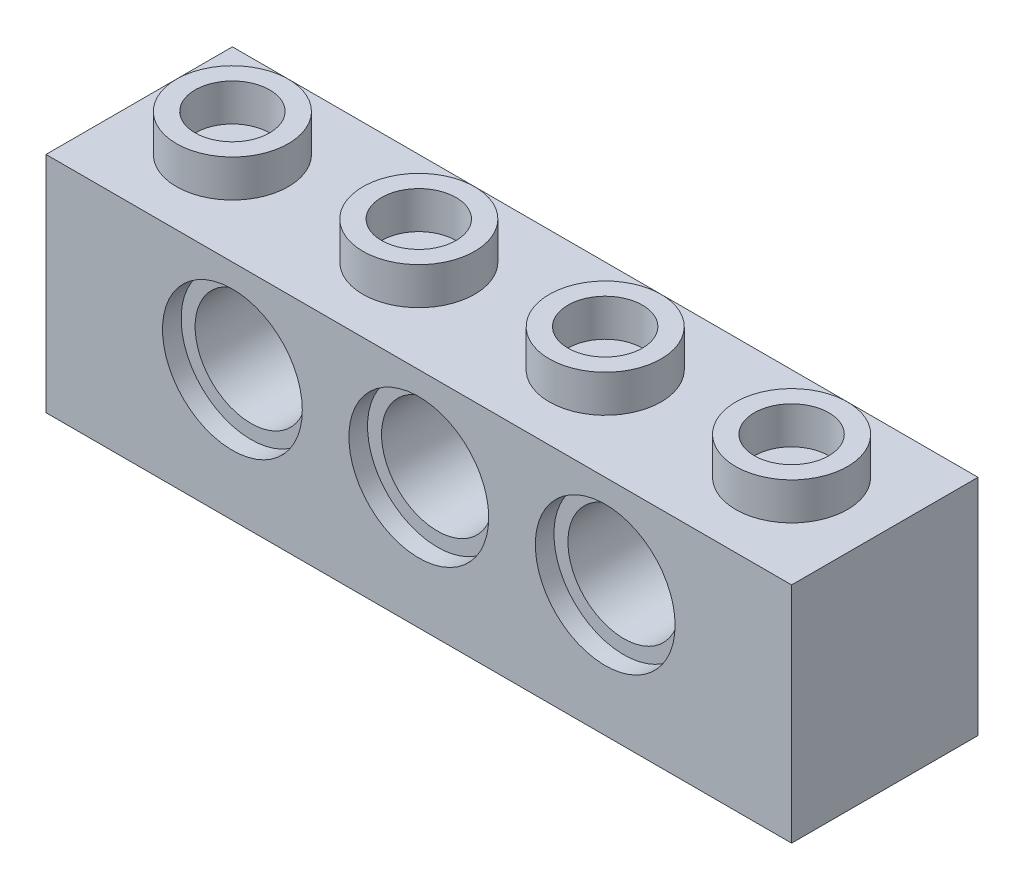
ISO-10303-21;
HEADER;
FILE_DESCRIPTION(('STEP AP214'),'2;1');
FILE_NAME('part.step','',(''),(''),'','','');
FILE_SCHEMA(('AUTOMOTIVE_DESIGN { 1 0 10303 214 1 1 1 1 }'));
ENDSEC;
DATA;
#1=APPLICATION_CONTEXT('core data for automotive mechanical design processes');
#2=APPLICATION_PROTOCOL_DEFINITION('international standard','automotive_design',2000,#1);
#3=PRODUCT_CONTEXT('',#1,'mechanical');
#4=PRODUCT('Part','Part','',(#3));
#5=PRODUCT_RELATED_PRODUCT_CATEGORY('part','',(#4));
#6=PRODUCT_DEFINITION_FORMATION('','',#4);
#7=PRODUCT_DEFINITION_CONTEXT('part definition',#1,'design');
#8=PRODUCT_DEFINITION('design','',#6,#7);
#9=PRODUCT_DEFINITION_SHAPE('','',#8);
#10=(LENGTH_UNIT() NAMED_UNIT(*) SI_UNIT(.MILLI.,.METRE.));
#11=(NAMED_UNIT(*) PLANE_ANGLE_UNIT() SI_UNIT($,.RADIAN.));
#12=(NAMED_UNIT(*) SI_UNIT($,.STERADIAN.) SOLID_ANGLE_UNIT());
#13=UNCERTAINTY_MEASURE_WITH_UNIT(LENGTH_MEASURE(1.E-05),#10,'distance_accuracy_value','');
#14=(GEOMETRIC_REPRESENTATION_CONTEXT(3) GLOBAL_UNCERTAINTY_ASSIGNED_CONTEXT((#13)) GLOBAL_UNIT_ASSIGNED_CONTEXT((#10,
#11,#12)) REPRESENTATION_CONTEXT('',''));
#15=CARTESIAN_POINT('',(0.,0.,0.));
#16=DIRECTION('',(0.,0.,1.));
#17=DIRECTION('',(1.,0.,0.));
#18=AXIS2_PLACEMENT_3D('',#15,#16,#17);
#19=CARTESIAN_POINT('',(8.,0.799999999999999,-4.));
#20=DIRECTION('',(0.,0.,1.));
#21=DIRECTION('',(1.,0.,0.));
#22=AXIS2_PLACEMENT_3D('',#19,#20,#21);
#23=CYLINDRICAL_SURFACE('',#22,2.4);
#24=CARTESIAN_POINT('',(8.,0.799999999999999,3.2));
#25=DIRECTION('',(0.,0.,1.));
#26=DIRECTION('',(1.,0.,0.));
#27=AXIS2_PLACEMENT_3D('',#24,#25,#26);
#28=CIRCLE('',#27,2.4);
#29=CARTESIAN_POINT('',(10.4,0.799999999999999,3.2));
#30=VERTEX_POINT('',#29);
#31=EDGE_CURVE('E774',#30,#30,#28,.F.);
#32=ORIENTED_EDGE('',*,*,#31,.F.);
#33=EDGE_LOOP('',(#32));
#34=FACE_BOUND('',#33,.T.);
#35=CARTESIAN_POINT('',(8.,0.799999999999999,-3.2));
#36=DIRECTION('',(0.,0.,-1.));
#37=DIRECTION('',(-1.,0.,0.));
#38=AXIS2_PLACEMENT_3D('',#35,#36,#37);
#39=CIRCLE('',#38,2.4);
#40=CARTESIAN_POINT('',(5.6,0.799999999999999,-3.2));
#41=VERTEX_POINT('',#40);
#42=EDGE_CURVE('E42',#41,#41,#39,.F.);
#43=ORIENTED_EDGE('',*,*,#42,.F.);
#44=EDGE_LOOP('',(#43));
#45=FACE_BOUND('',#44,.T.);
#46=ADVANCED_FACE('F38',(#34,#45),#23,.F.);
#47=CARTESIAN_POINT('',(0.,0.799999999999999,-4.));
#48=DIRECTION('',(0.,0.,1.));
#49=DIRECTION('',(1.,0.,0.));
#50=AXIS2_PLACEMENT_3D('',#47,#48,#49);
#51=CYLINDRICAL_SURFACE('',#50,2.4);
#52=CARTESIAN_POINT('',(0.,0.799999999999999,3.2));
#53=DIRECTION('',(0.,0.,1.));
#54=DIRECTION('',(1.,0.,0.));
#55=AXIS2_PLACEMENT_3D('',#52,#53,#54);
#56=CIRCLE('',#55,2.4);
#57=CARTESIAN_POINT('',(2.4,0.799999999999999,3.2));
#58=VERTEX_POINT('',#57);
#59=EDGE_CURVE('E782',#58,#58,#56,.F.);
#60=ORIENTED_EDGE('',*,*,#59,.F.);
#61=EDGE_LOOP('',(#60));
#62=FACE_BOUND('',#61,.T.);
#63=CARTESIAN_POINT('',(0.,0.799999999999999,-3.2));
#64=DIRECTION('',(0.,0.,-1.));
#65=DIRECTION('',(-1.,0.,0.));
#66=AXIS2_PLACEMENT_3D('',#63,#64,#65);
#67=CIRCLE('',#66,2.4);
#68=CARTESIAN_POINT('',(-2.4,0.799999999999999,-3.2));
#69=VERTEX_POINT('',#68);
#70=EDGE_CURVE('E788',#69,#69,#67,.F.);
#71=ORIENTED_EDGE('',*,*,#70,.F.);
#72=EDGE_LOOP('',(#71));
#73=FACE_BOUND('',#72,.T.);
#74=ADVANCED_FACE('F375',(#62,#73),#51,.F.);
#75=CARTESIAN_POINT('',(-8.,0.799999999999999,-4.));
#76=DIRECTION('',(0.,0.,1.));
#77=DIRECTION('',(1.,0.,0.));
#78=AXIS2_PLACEMENT_3D('',#75,#76,#77);
#79=CYLINDRICAL_SURFACE('',#78,2.4);
#80=CARTESIAN_POINT('',(-8.,0.799999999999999,3.2));
#81=DIRECTION('',(0.,0.,1.));
#82=DIRECTION('',(1.,0.,0.));
#83=AXIS2_PLACEMENT_3D('',#80,#81,#82);
#84=CIRCLE('',#83,2.4);
#85=CARTESIAN_POINT('',(-5.6,0.799999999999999,3.2));
#86=VERTEX_POINT('',#85);
#87=EDGE_CURVE('E351',#86,#86,#84,.F.);
#88=ORIENTED_EDGE('',*,*,#87,.F.);
#89=EDGE_LOOP('',(#88));
#90=FACE_BOUND('',#89,.T.);
#91=CARTESIAN_POINT('',(-8.,0.799999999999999,-3.2));
#92=DIRECTION('',(0.,0.,-1.));
#93=DIRECTION('',(-1.,0.,0.));
#94=AXIS2_PLACEMENT_3D('',#91,#92,#93);
#95=CIRCLE('',#94,2.4);
#96=CARTESIAN_POINT('',(-10.4,0.799999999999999,-3.2));
#97=VERTEX_POINT('',#96);
#98=EDGE_CURVE('E738',#97,#97,#95,.F.);
#99=ORIENTED_EDGE('',*,*,#98,.F.);
#100=EDGE_LOOP('',(#99));
#101=FACE_BOUND('',#100,.T.);
#102=ADVANCED_FACE('F381',(#90,#101),#79,.F.);
#103=CARTESIAN_POINT('',(16.,4.8,-4.));
#104=DIRECTION('',(1.,0.,0.));
#105=DIRECTION('',(0.,0.,-1.));
#106=AXIS2_PLACEMENT_3D('',#103,#104,#105);
#107=PLANE('',#106);
#108=DIRECTION('',(0.,0.,1.));
#109=VECTOR('',#108,1.);
#110=CARTESIAN_POINT('',(16.,4.8,-4.));
#111=LINE('',#110,#109);
#112=CARTESIAN_POINT('',(16.,4.8,-4.));
#113=VERTEX_POINT('',#112);
#114=CARTESIAN_POINT('',(16.,4.8,4.));
#115=VERTEX_POINT('',#114);
#116=EDGE_CURVE('E282',#113,#115,#111,.T.);
#117=ORIENTED_EDGE('',*,*,#116,.T.);
#118=DIRECTION('',(0.,1.,0.));
#119=VECTOR('',#118,1.);
#120=CARTESIAN_POINT('',(16.,4.8,4.));
#121=LINE('',#120,#119);
#122=CARTESIAN_POINT('',(16.,-4.8,4.));
#123=VERTEX_POINT('',#122);
#124=EDGE_CURVE('E257',#123,#115,#121,.T.);
#125=ORIENTED_EDGE('',*,*,#124,.F.);
#126=DIRECTION('',(0.,0.,1.));
#127=VECTOR('',#126,1.);
#128=CARTESIAN_POINT('',(16.,-4.8,-4.));
#129=LINE('',#128,#127);
#130=CARTESIAN_POINT('',(16.,-4.8,-4.));
#131=VERTEX_POINT('',#130);
#132=EDGE_CURVE('E63',#131,#123,#129,.T.);
#133=ORIENTED_EDGE('',*,*,#132,.F.);
#134=DIRECTION('',(0.,1.,0.));
#135=VECTOR('',#134,1.);
#136=CARTESIAN_POINT('',(16.,4.8,-4.));
#137=LINE('',#136,#135);
#138=EDGE_CURVE('E271',#131,#113,#137,.T.);
#139=ORIENTED_EDGE('',*,*,#138,.T.);
#140=EDGE_LOOP('',(#117,#125,#133,#139));
#141=FACE_BOUND('',#140,.T.);
#142=ADVANCED_FACE('F40',(#141),#107,.T.);
#143=CARTESIAN_POINT('',(-16.,-4.8,-4.));
#144=DIRECTION('',(0.,-1.,0.));
#145=DIRECTION('',(0.,0.,-1.));
#146=AXIS2_PLACEMENT_3D('',#143,#144,#145);
#147=PLANE('',#146);
#148=DIRECTION('',(0.,0.,1.));
#149=VECTOR('',#148,1.);
#150=CARTESIAN_POINT('',(14.4,-4.8,-4.));
#151=LINE('',#150,#149);
#152=CARTESIAN_POINT('',(14.4,-4.8,-2.4));
#153=VERTEX_POINT('',#152);
#154=CARTESIAN_POINT('',(14.4,-4.8,2.4));
#155=VERTEX_POINT('',#154);
#156=EDGE_CURVE('E170',#153,#155,#151,.T.);
#157=ORIENTED_EDGE('',*,*,#156,.F.);
#158=DIRECTION('',(1.,0.,0.));
#159=VECTOR('',#158,1.);
#160=CARTESIAN_POINT('',(0.,-4.8,-2.4));
#161=LINE('',#160,#159);
#162=CARTESIAN_POINT('',(-14.4,-4.8,-2.4));
#163=VERTEX_POINT('',#162);
#164=EDGE_CURVE('E153',#163,#153,#161,.T.);
#165=ORIENTED_EDGE('',*,*,#164,.F.);
#166=DIRECTION('',(0.,0.,1.));
#167=VECTOR('',#166,1.);
#168=CARTESIAN_POINT('',(-14.4,-4.8,-4.));
#169=LINE('',#168,#167);
#170=CARTESIAN_POINT('',(-14.4,-4.8,2.4));
#171=VERTEX_POINT('',#170);
#172=EDGE_CURVE('E183',#163,#171,#169,.T.);
#173=ORIENTED_EDGE('',*,*,#172,.T.);
#174=DIRECTION('',(1.,0.,0.));
#175=VECTOR('',#174,1.);
#176=CARTESIAN_POINT('',(0.,-4.8,2.4));
#177=LINE('',#176,#175);
#178=EDGE_CURVE('E182',#171,#155,#177,.T.);
#179=ORIENTED_EDGE('',*,*,#178,.T.);
#180=EDGE_LOOP('',(#157,#165,#173,#179));
#181=FACE_BOUND('',#180,.T.);
#182=ORIENTED_EDGE('',*,*,#132,.T.);
#183=DIRECTION('',(1.,0.,0.));
#184=VECTOR('',#183,1.);
#185=CARTESIAN_POINT('',(-16.,-4.8,4.));
#186=LINE('',#185,#184);
#187=CARTESIAN_POINT('',(-16.,-4.8,4.));
#188=VERTEX_POINT('',#187);
#189=EDGE_CURVE('E268',#188,#123,#186,.T.);
#190=ORIENTED_EDGE('',*,*,#189,.F.);
#191=DIRECTION('',(0.,0.,1.));
#192=VECTOR('',#191,1.);
#193=CARTESIAN_POINT('',(-16.,-4.8,-4.));
#194=LINE('',#193,#192);
#195=CARTESIAN_POINT('',(-16.,-4.8,-4.));
#196=VERTEX_POINT('',#195);
#197=EDGE_CURVE('E285',#196,#188,#194,.T.);
#198=ORIENTED_EDGE('',*,*,#197,.F.);
#199=DIRECTION('',(1.,0.,0.));
#200=VECTOR('',#199,1.);
#201=CARTESIAN_POINT('',(-16.,-4.8,-4.));
#202=LINE('',#201,#200);
#203=EDGE_CURVE('E279',#196,#131,#202,.T.);
#204=ORIENTED_EDGE('',*,*,#203,.T.);
#205=EDGE_LOOP('',(#182,#190,#198,#204));
#206=FACE_BOUND('',#205,.T.);
#207=ADVANCED_FACE('F448',(#181,#206),#147,.T.);
#208=CARTESIAN_POINT('',(-16.,4.8,-4.));
#209=DIRECTION('',(-1.,0.,0.));
#210=DIRECTION('',(0.,0.,1.));
#211=AXIS2_PLACEMENT_3D('',#208,#209,#210);
#212=PLANE('',#211);
#213=ORIENTED_EDGE('',*,*,#197,.T.);
#214=DIRECTION('',(0.,-1.,0.));
#215=VECTOR('',#214,1.);
#216=CARTESIAN_POINT('',(-16.,4.8,4.));
#217=LINE('',#216,#215);
#218=CARTESIAN_POINT('',(-16.,4.8,4.));
#219=VERTEX_POINT('',#218);
#220=EDGE_CURVE('E265',#219,#188,#217,.T.);
#221=ORIENTED_EDGE('',*,*,#220,.F.);
#222=DIRECTION('',(0.,0.,1.));
#223=VECTOR('',#222,1.);
#224=CARTESIAN_POINT('',(-16.,4.8,-4.));
#225=LINE('',#224,#223);
#226=CARTESIAN_POINT('',(-16.,4.8,-4.));
#227=VERTEX_POINT('',#226);
#228=EDGE_CURVE('E287',#227,#219,#225,.T.);
#229=ORIENTED_EDGE('',*,*,#228,.F.);
#230=DIRECTION('',(0.,-1.,0.));
#231=VECTOR('',#230,1.);
#232=CARTESIAN_POINT('',(-16.,4.8,-4.));
#233=LINE('',#232,#231);
#234=EDGE_CURVE('E276',#227,#196,#233,.T.);
#235=ORIENTED_EDGE('',*,*,#234,.T.);
#236=EDGE_LOOP('',(#213,#221,#229,#235));
#237=FACE_BOUND('',#236,.T.);
#238=ADVANCED_FACE('F451',(#237),#212,.T.);
#239=CARTESIAN_POINT('',(-16.,4.8,-4.));
#240=DIRECTION('',(0.,1.,0.));
#241=DIRECTION('',(0.,0.,1.));
#242=AXIS2_PLACEMENT_3D('',#239,#240,#241);
#243=PLANE('',#242);
#244=CARTESIAN_POINT('',(12.,4.8,0.));
#245=DIRECTION('',(0.,1.,0.));
#246=DIRECTION('',(0.,0.,1.));
#247=AXIS2_PLACEMENT_3D('',#244,#245,#246);
#248=CIRCLE('',#247,2.4);
#249=CARTESIAN_POINT('',(12.,4.8,2.4));
#250=VERTEX_POINT('',#249);
#251=EDGE_CURVE('E226',#250,#250,#248,.T.);
#252=ORIENTED_EDGE('',*,*,#251,.F.);
#253=EDGE_LOOP('',(#252));
#254=FACE_BOUND('',#253,.T.);
#255=CARTESIAN_POINT('',(4.,4.8,0.));
#256=DIRECTION('',(0.,1.,0.));
#257=DIRECTION('',(0.,0.,1.));
#258=AXIS2_PLACEMENT_3D('',#255,#256,#257);
#259=CIRCLE('',#258,2.4);
#260=CARTESIAN_POINT('',(4.,4.8,2.4));
#261=VERTEX_POINT('',#260);
#262=EDGE_CURVE('E235',#261,#261,#259,.T.);
#263=ORIENTED_EDGE('',*,*,#262,.F.);
#264=EDGE_LOOP('',(#263));
#265=FACE_BOUND('',#264,.T.);
#266=CARTESIAN_POINT('',(-4.,4.8,0.));
#267=DIRECTION('',(0.,1.,0.));
#268=DIRECTION('',(0.,0.,1.));
#269=AXIS2_PLACEMENT_3D('',#266,#267,#268);
#270=CIRCLE('',#269,2.4);
#271=CARTESIAN_POINT('',(-4.,4.8,2.4));
#272=VERTEX_POINT('',#271);
#273=EDGE_CURVE('E244',#272,#272,#270,.T.);
#274=ORIENTED_EDGE('',*,*,#273,.F.);
#275=EDGE_LOOP('',(#274));
#276=FACE_BOUND('',#275,.T.);
#277=CARTESIAN_POINT('',(-12.,4.8,0.));
#278=DIRECTION('',(0.,1.,0.));
#279=DIRECTION('',(0.,0.,1.));
#280=AXIS2_PLACEMENT_3D('',#277,#278,#279);
#281=CIRCLE('',#280,2.4);
#282=CARTESIAN_POINT('',(-12.,4.8,2.4));
#283=VERTEX_POINT('',#282);
#284=EDGE_CURVE('E253',#283,#283,#281,.T.);
#285=ORIENTED_EDGE('',*,*,#284,.F.);
#286=EDGE_LOOP('',(#285));
#287=FACE_BOUND('',#286,.T.);
#288=ORIENTED_EDGE('',*,*,#228,.T.);
#289=DIRECTION('',(-1.,0.,0.));
#290=VECTOR('',#289,1.);
#291=CARTESIAN_POINT('',(-16.,4.8,4.));
#292=LINE('',#291,#290);
#293=EDGE_CURVE('E262',#115,#219,#292,.T.);
#294=ORIENTED_EDGE('',*,*,#293,.F.);
#295=ORIENTED_EDGE('',*,*,#116,.F.);
#296=DIRECTION('',(-1.,0.,0.));
#297=VECTOR('',#296,1.);
#298=CARTESIAN_POINT('',(-16.,4.8,-4.));
#299=LINE('',#298,#297);
#300=EDGE_CURVE('E273',#113,#227,#299,.T.);
#301=ORIENTED_EDGE('',*,*,#300,.T.);
#302=EDGE_LOOP('',(#288,#294,#295,#301));
#303=FACE_BOUND('',#302,.T.);
#304=ADVANCED_FACE('F446',(#254,#265,#276,#287,#303),#243,.T.);
#305=CARTESIAN_POINT('',(0.,0.,-4.));
#306=DIRECTION('',(0.,0.,1.));
#307=DIRECTION('',(1.,0.,0.));
#308=AXIS2_PLACEMENT_3D('',#305,#306,#307);
#309=PLANE('',#308);
#310=CARTESIAN_POINT('',(-8.,0.799999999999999,-4.));
#311=DIRECTION('',(0.,0.,1.));
#312=DIRECTION('',(1.,0.,0.));
#313=AXIS2_PLACEMENT_3D('',#310,#311,#312);
#314=CIRCLE('',#313,3.);
#315=CARTESIAN_POINT('',(-5.,0.799999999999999,-4.));
#316=VERTEX_POINT('',#315);
#317=EDGE_CURVE('E735',#316,#316,#314,.T.);
#318=ORIENTED_EDGE('',*,*,#317,.T.);
#319=EDGE_LOOP('',(#318));
#320=FACE_BOUND('',#319,.T.);
#321=CARTESIAN_POINT('',(0.,0.799999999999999,-4.));
#322=DIRECTION('',(0.,0.,1.));
#323=DIRECTION('',(1.,0.,0.));
#324=AXIS2_PLACEMENT_3D('',#321,#322,#323);
#325=CIRCLE('',#324,3.);
#326=CARTESIAN_POINT('',(3.,0.799999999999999,-4.));
#327=VERTEX_POINT('',#326);
#328=EDGE_CURVE('E741',#327,#327,#325,.T.);
#329=ORIENTED_EDGE('',*,*,#328,.T.);
#330=EDGE_LOOP('',(#329));
#331=FACE_BOUND('',#330,.T.);
#332=CARTESIAN_POINT('',(8.,0.799999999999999,-4.));
#333=DIRECTION('',(0.,0.,1.));
#334=DIRECTION('',(1.,0.,0.));
#335=AXIS2_PLACEMENT_3D('',#332,#333,#334);
#336=CIRCLE('',#335,3.);
#337=CARTESIAN_POINT('',(11.,0.799999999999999,-4.));
#338=VERTEX_POINT('',#337);
#339=EDGE_CURVE('E749',#338,#338,#336,.T.);
#340=ORIENTED_EDGE('',*,*,#339,.T.);
#341=EDGE_LOOP('',(#340));
#342=FACE_BOUND('',#341,.T.);
#343=ORIENTED_EDGE('',*,*,#138,.F.);
#344=ORIENTED_EDGE('',*,*,#203,.F.);
#345=ORIENTED_EDGE('',*,*,#234,.F.);
#346=ORIENTED_EDGE('',*,*,#300,.F.);
#347=EDGE_LOOP('',(#343,#344,#345,#346));
#348=FACE_BOUND('',#347,.T.);
#349=ADVANCED_FACE('F442',(#320,#331,#342,#348),#309,.F.);
#350=CARTESIAN_POINT('',(0.,0.,4.));
#351=DIRECTION('',(0.,0.,1.));
#352=DIRECTION('',(1.,0.,0.));
#353=AXIS2_PLACEMENT_3D('',#350,#351,#352);
#354=PLANE('',#353);
#355=CARTESIAN_POINT('',(-8.,0.799999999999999,4.));
#356=DIRECTION('',(0.,0.,1.));
#357=DIRECTION('',(1.,0.,0.));
#358=AXIS2_PLACEMENT_3D('',#355,#356,#357);
#359=CIRCLE('',#358,3.);
#360=CARTESIAN_POINT('',(-5.,0.799999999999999,4.));
#361=VERTEX_POINT('',#360);
#362=EDGE_CURVE('E755',#361,#361,#359,.T.);
#363=ORIENTED_EDGE('',*,*,#362,.F.);
#364=EDGE_LOOP('',(#363));
#365=FACE_BOUND('',#364,.T.);
#366=CARTESIAN_POINT('',(0.,0.799999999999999,4.));
#367=DIRECTION('',(0.,0.,1.));
#368=DIRECTION('',(1.,0.,0.));
#369=AXIS2_PLACEMENT_3D('',#366,#367,#368);
#370=CIRCLE('',#369,3.);
#371=CARTESIAN_POINT('',(3.,0.799999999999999,4.));
#372=VERTEX_POINT('',#371);
#373=EDGE_CURVE('E761',#372,#372,#370,.T.);
#374=ORIENTED_EDGE('',*,*,#373,.F.);
#375=EDGE_LOOP('',(#374));
#376=FACE_BOUND('',#375,.T.);
#377=CARTESIAN_POINT('',(8.,0.799999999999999,4.));
#378=DIRECTION('',(0.,0.,1.));
#379=DIRECTION('',(1.,0.,0.));
#380=AXIS2_PLACEMENT_3D('',#377,#378,#379);
#381=CIRCLE('',#380,3.);
#382=CARTESIAN_POINT('',(11.,0.799999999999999,4.));
#383=VERTEX_POINT('',#382);
#384=EDGE_CURVE('E767',#383,#383,#381,.T.);
#385=ORIENTED_EDGE('',*,*,#384,.F.);
#386=EDGE_LOOP('',(#385));
#387=FACE_BOUND('',#386,.T.);
#388=ORIENTED_EDGE('',*,*,#124,.T.);
#389=ORIENTED_EDGE('',*,*,#293,.T.);
#390=ORIENTED_EDGE('',*,*,#220,.T.);
#391=ORIENTED_EDGE('',*,*,#189,.T.);
#392=EDGE_LOOP('',(#388,#389,#390,#391));
#393=FACE_BOUND('',#392,.T.);
#394=ADVANCED_FACE('F435',(#365,#376,#387,#393),#354,.T.);
#395=CARTESIAN_POINT('',(-12.,6.4,0.));
#396=DIRECTION('',(0.,1.,0.));
#397=DIRECTION('',(0.,0.,1.));
#398=AXIS2_PLACEMENT_3D('',#395,#396,#397);
#399=PLANE('',#398);
#400=CARTESIAN_POINT('',(-12.,6.4,0.));
#401=DIRECTION('',(0.,1.,0.));
#402=DIRECTION('',(0.,0.,1.));
#403=AXIS2_PLACEMENT_3D('',#400,#401,#402);
#404=CIRCLE('',#403,2.4);
#405=CARTESIAN_POINT('',(-12.,6.4,2.4));
#406=VERTEX_POINT('',#405);
#407=EDGE_CURVE('E254',#406,#406,#404,.T.);
#408=ORIENTED_EDGE('',*,*,#407,.T.);
#409=EDGE_LOOP('',(#408));
#410=FACE_BOUND('',#409,.T.);
#411=CARTESIAN_POINT('',(-12.,6.4,0.));
#412=DIRECTION('',(0.,1.,0.));
#413=DIRECTION('',(0.,0.,1.));
#414=AXIS2_PLACEMENT_3D('',#411,#412,#413);
#415=CIRCLE('',#414,1.6);
#416=CARTESIAN_POINT('',(-12.,6.4,1.6));
#417=VERTEX_POINT('',#416);
#418=EDGE_CURVE('E248',#417,#417,#415,.T.);
#419=ORIENTED_EDGE('',*,*,#418,.F.);
#420=EDGE_LOOP('',(#419));
#421=FACE_BOUND('',#420,.T.);
#422=ADVANCED_FACE('F432',(#410,#421),#399,.T.);
#423=CARTESIAN_POINT('',(-12.,6.4,0.));
#424=DIRECTION('',(0.,-1.,0.));
#425=DIRECTION('',(0.,0.,-1.));
#426=AXIS2_PLACEMENT_3D('',#423,#424,#425);
#427=CYLINDRICAL_SURFACE('',#426,2.4);
#428=ORIENTED_EDGE('',*,*,#407,.F.);
#429=EDGE_LOOP('',(#428));
#430=FACE_BOUND('',#429,.T.);
#431=ORIENTED_EDGE('',*,*,#284,.T.);
#432=EDGE_LOOP('',(#431));
#433=FACE_BOUND('',#432,.T.);
#434=ADVANCED_FACE('F430',(#430,#433),#427,.T.);
#435=CARTESIAN_POINT('',(-12.,6.4,0.));
#436=DIRECTION('',(0.,-1.,0.));
#437=DIRECTION('',(0.,0.,-1.));
#438=AXIS2_PLACEMENT_3D('',#435,#436,#437);
#439=CYLINDRICAL_SURFACE('',#438,1.6);
#440=ORIENTED_EDGE('',*,*,#418,.T.);
#441=EDGE_LOOP('',(#440));
#442=FACE_BOUND('',#441,.T.);
#443=CARTESIAN_POINT('',(-12.,4.8,0.));
#444=DIRECTION('',(0.,1.,0.));
#445=DIRECTION('',(0.,0.,1.));
#446=AXIS2_PLACEMENT_3D('',#443,#444,#445);
#447=CIRCLE('',#446,1.6);
#448=CARTESIAN_POINT('',(-12.,4.8,1.6));
#449=VERTEX_POINT('',#448);
#450=EDGE_CURVE('E284',#449,#449,#447,.F.);
#451=ORIENTED_EDGE('',*,*,#450,.T.);
#452=EDGE_LOOP('',(#451));
#453=FACE_BOUND('',#452,.T.);
#454=ADVANCED_FACE('F427',(#442,#453),#439,.F.);
#455=ORIENTED_EDGE('',*,*,#450,.F.);
#456=EDGE_LOOP('',(#455));
#457=FACE_BOUND('',#456,.T.);
#458=ADVANCED_FACE('F422',(#457),#243,.T.);
#459=CARTESIAN_POINT('',(-4.,6.4,0.));
#460=DIRECTION('',(0.,1.,0.));
#461=DIRECTION('',(0.,0.,1.));
#462=AXIS2_PLACEMENT_3D('',#459,#460,#461);
#463=PLANE('',#462);
#464=CARTESIAN_POINT('',(-4.,6.4,0.));
#465=DIRECTION('',(0.,1.,0.));
#466=DIRECTION('',(0.,0.,1.));
#467=AXIS2_PLACEMENT_3D('',#464,#465,#466);
#468=CIRCLE('',#467,2.4);
#469=CARTESIAN_POINT('',(-4.,6.4,2.4));
#470=VERTEX_POINT('',#469);
#471=EDGE_CURVE('E245',#470,#470,#468,.T.);
#472=ORIENTED_EDGE('',*,*,#471,.T.);
#473=EDGE_LOOP('',(#472));
#474=FACE_BOUND('',#473,.T.);
#475=CARTESIAN_POINT('',(-4.,6.4,0.));
#476=DIRECTION('',(0.,1.,0.));
#477=DIRECTION('',(0.,0.,1.));
#478=AXIS2_PLACEMENT_3D('',#475,#476,#477);
#479=CIRCLE('',#478,1.6);
#480=CARTESIAN_POINT('',(-4.,6.4,1.6));
#481=VERTEX_POINT('',#480);
#482=EDGE_CURVE('E239',#481,#481,#479,.T.);
#483=ORIENTED_EDGE('',*,*,#482,.F.);
#484=EDGE_LOOP('',(#483));
#485=FACE_BOUND('',#484,.T.);
#486=ADVANCED_FACE('F419',(#474,#485),#463,.T.);
#487=CARTESIAN_POINT('',(-4.,6.4,0.));
#488=DIRECTION('',(0.,-1.,0.));
#489=DIRECTION('',(0.,0.,-1.));
#490=AXIS2_PLACEMENT_3D('',#487,#488,#489);
#491=CYLINDRICAL_SURFACE('',#490,2.4);
#492=ORIENTED_EDGE('',*,*,#471,.F.);
#493=EDGE_LOOP('',(#492));
#494=FACE_BOUND('',#493,.T.);
#495=ORIENTED_EDGE('',*,*,#273,.T.);
#496=EDGE_LOOP('',(#495));
#497=FACE_BOUND('',#496,.T.);
#498=ADVANCED_FACE('F417',(#494,#497),#491,.T.);
#499=CARTESIAN_POINT('',(-4.,6.4,0.));
#500=DIRECTION('',(0.,-1.,0.));
#501=DIRECTION('',(0.,0.,-1.));
#502=AXIS2_PLACEMENT_3D('',#499,#500,#501);
#503=CYLINDRICAL_SURFACE('',#502,1.6);
#504=ORIENTED_EDGE('',*,*,#482,.T.);
#505=EDGE_LOOP('',(#504));
#506=FACE_BOUND('',#505,.T.);
#507=CARTESIAN_POINT('',(-4.,4.8,0.));
#508=DIRECTION('',(0.,1.,0.));
#509=DIRECTION('',(0.,0.,1.));
#510=AXIS2_PLACEMENT_3D('',#507,#508,#509);
#511=CIRCLE('',#510,1.6);
#512=CARTESIAN_POINT('',(-4.,4.8,1.6));
#513=VERTEX_POINT('',#512);
#514=EDGE_CURVE('E292',#513,#513,#511,.F.);
#515=ORIENTED_EDGE('',*,*,#514,.T.);
#516=EDGE_LOOP('',(#515));
#517=FACE_BOUND('',#516,.T.);
#518=ADVANCED_FACE('F414',(#506,#517),#503,.F.);
#519=ORIENTED_EDGE('',*,*,#514,.F.);
#520=EDGE_LOOP('',(#519));
#521=FACE_BOUND('',#520,.T.);
#522=ADVANCED_FACE('F409',(#521),#243,.T.);
#523=CARTESIAN_POINT('',(4.,6.4,0.));
#524=DIRECTION('',(0.,1.,0.));
#525=DIRECTION('',(0.,0.,1.));
#526=AXIS2_PLACEMENT_3D('',#523,#524,#525);
#527=PLANE('',#526);
#528=CARTESIAN_POINT('',(4.,6.4,0.));
#529=DIRECTION('',(0.,1.,0.));
#530=DIRECTION('',(0.,0.,1.));
#531=AXIS2_PLACEMENT_3D('',#528,#529,#530);
#532=CIRCLE('',#531,2.4);
#533=CARTESIAN_POINT('',(4.,6.4,2.4));
#534=VERTEX_POINT('',#533);
#535=EDGE_CURVE('E236',#534,#534,#532,.T.);
#536=ORIENTED_EDGE('',*,*,#535,.T.);
#537=EDGE_LOOP('',(#536));
#538=FACE_BOUND('',#537,.T.);
#539=CARTESIAN_POINT('',(4.,6.4,0.));
#540=DIRECTION('',(0.,1.,0.));
#541=DIRECTION('',(0.,0.,1.));
#542=AXIS2_PLACEMENT_3D('',#539,#540,#541);
#543=CIRCLE('',#542,1.6);
#544=CARTESIAN_POINT('',(4.,6.4,1.6));
#545=VERTEX_POINT('',#544);
#546=EDGE_CURVE('E230',#545,#545,#543,.T.);
#547=ORIENTED_EDGE('',*,*,#546,.F.);
#548=EDGE_LOOP('',(#547));
#549=FACE_BOUND('',#548,.T.);
#550=ADVANCED_FACE('F406',(#538,#549),#527,.T.);
#551=CARTESIAN_POINT('',(4.,6.4,0.));
#552=DIRECTION('',(0.,-1.,0.));
#553=DIRECTION('',(0.,0.,-1.));
#554=AXIS2_PLACEMENT_3D('',#551,#552,#553);
#555=CYLINDRICAL_SURFACE('',#554,2.4);
#556=ORIENTED_EDGE('',*,*,#535,.F.);
#557=EDGE_LOOP('',(#556));
#558=FACE_BOUND('',#557,.T.);
#559=ORIENTED_EDGE('',*,*,#262,.T.);
#560=EDGE_LOOP('',(#559));
#561=FACE_BOUND('',#560,.T.);
#562=ADVANCED_FACE('F404',(#558,#561),#555,.T.);
#563=CARTESIAN_POINT('',(4.,6.4,0.));
#564=DIRECTION('',(0.,-1.,0.));
#565=DIRECTION('',(0.,0.,-1.));
#566=AXIS2_PLACEMENT_3D('',#563,#564,#565);
#567=CYLINDRICAL_SURFACE('',#566,1.6);
#568=ORIENTED_EDGE('',*,*,#546,.T.);
#569=EDGE_LOOP('',(#568));
#570=FACE_BOUND('',#569,.T.);
#571=CARTESIAN_POINT('',(4.,4.8,0.));
#572=DIRECTION('',(0.,1.,0.));
#573=DIRECTION('',(0.,0.,1.));
#574=AXIS2_PLACEMENT_3D('',#571,#572,#573);
#575=CIRCLE('',#574,1.6);
#576=CARTESIAN_POINT('',(4.,4.8,1.6));
#577=VERTEX_POINT('',#576);
#578=EDGE_CURVE('E295',#577,#577,#575,.F.);
#579=ORIENTED_EDGE('',*,*,#578,.T.);
#580=EDGE_LOOP('',(#579));
#581=FACE_BOUND('',#580,.T.);
#582=ADVANCED_FACE('F401',(#570,#581),#567,.F.);
#583=ORIENTED_EDGE('',*,*,#578,.F.);
#584=EDGE_LOOP('',(#583));
#585=FACE_BOUND('',#584,.T.);
#586=ADVANCED_FACE('F396',(#585),#243,.T.);
#587=CARTESIAN_POINT('',(12.,6.4,0.));
#588=DIRECTION('',(0.,1.,0.));
#589=DIRECTION('',(0.,0.,1.));
#590=AXIS2_PLACEMENT_3D('',#587,#588,#589);
#591=PLANE('',#590);
#592=CARTESIAN_POINT('',(12.,6.4,0.));
#593=DIRECTION('',(0.,1.,0.));
#594=DIRECTION('',(0.,0.,1.));
#595=AXIS2_PLACEMENT_3D('',#592,#593,#594);
#596=CIRCLE('',#595,2.4);
#597=CARTESIAN_POINT('',(12.,6.4,2.4));
#598=VERTEX_POINT('',#597);
#599=EDGE_CURVE('E227',#598,#598,#596,.T.);
#600=ORIENTED_EDGE('',*,*,#599,.T.);
#601=EDGE_LOOP('',(#600));
#602=FACE_BOUND('',#601,.T.);
#603=CARTESIAN_POINT('',(12.,6.4,0.));
#604=DIRECTION('',(0.,1.,0.));
#605=DIRECTION('',(0.,0.,1.));
#606=AXIS2_PLACEMENT_3D('',#603,#604,#605);
#607=CIRCLE('',#606,1.6);
#608=CARTESIAN_POINT('',(12.,6.4,1.6));
#609=VERTEX_POINT('',#608);
#610=EDGE_CURVE('E223',#609,#609,#607,.T.);
#611=ORIENTED_EDGE('',*,*,#610,.F.);
#612=EDGE_LOOP('',(#611));
#613=FACE_BOUND('',#612,.T.);
#614=ADVANCED_FACE('F393',(#602,#613),#591,.T.);
#615=CARTESIAN_POINT('',(12.,6.4,0.));
#616=DIRECTION('',(0.,-1.,0.));
#617=DIRECTION('',(0.,0.,-1.));
#618=AXIS2_PLACEMENT_3D('',#615,#616,#617);
#619=CYLINDRICAL_SURFACE('',#618,2.4);
#620=ORIENTED_EDGE('',*,*,#599,.F.);
#621=EDGE_LOOP('',(#620));
#622=FACE_BOUND('',#621,.T.);
#623=ORIENTED_EDGE('',*,*,#251,.T.);
#624=EDGE_LOOP('',(#623));
#625=FACE_BOUND('',#624,.T.);
#626=ADVANCED_FACE('F391',(#622,#625),#619,.T.);
#627=CARTESIAN_POINT('',(12.,6.4,0.));
#628=DIRECTION('',(0.,-1.,0.));
#629=DIRECTION('',(0.,0.,-1.));
#630=AXIS2_PLACEMENT_3D('',#627,#628,#629);
#631=CYLINDRICAL_SURFACE('',#630,1.6);
#632=ORIENTED_EDGE('',*,*,#610,.T.);
#633=EDGE_LOOP('',(#632));
#634=FACE_BOUND('',#633,.T.);
#635=CARTESIAN_POINT('',(12.,4.8,0.));
#636=DIRECTION('',(0.,1.,0.));
#637=DIRECTION('',(0.,0.,1.));
#638=AXIS2_PLACEMENT_3D('',#635,#636,#637);
#639=CIRCLE('',#638,1.6);
#640=CARTESIAN_POINT('',(12.,4.8,1.6));
#641=VERTEX_POINT('',#640);
#642=EDGE_CURVE('E298',#641,#641,#639,.F.);
#643=ORIENTED_EDGE('',*,*,#642,.T.);
#644=EDGE_LOOP('',(#643));
#645=FACE_BOUND('',#644,.T.);
#646=ADVANCED_FACE('F387',(#634,#645),#631,.F.);
#647=ORIENTED_EDGE('',*,*,#642,.F.);
#648=EDGE_LOOP('',(#647));
#649=FACE_BOUND('',#648,.T.);
#650=ADVANCED_FACE('F390',(#649),#243,.T.);
#651=CARTESIAN_POINT('',(-16.,3.2,-4.));
#652=DIRECTION('',(0.,1.,0.));
#653=DIRECTION('',(0.,0.,1.));
#654=AXIS2_PLACEMENT_3D('',#651,#652,#653);
#655=PLANE('',#654);
#656=DIRECTION('',(-1.,0.,0.));
#657=VECTOR('',#656,1.);
#658=CARTESIAN_POINT('',(0.,3.2,2.4));
#659=LINE('',#658,#657);
#660=CARTESIAN_POINT('',(14.4,3.2,2.4));
#661=VERTEX_POINT('',#660);
#662=CARTESIAN_POINT('',(10.4083189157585,3.2,2.4));
#663=VERTEX_POINT('',#662);
#664=EDGE_CURVE('E146',#661,#663,#659,.T.);
#665=ORIENTED_EDGE('',*,*,#664,.T.);
#666=DIRECTION('',(0.,0.,1.));
#667=VECTOR('',#666,1.);
#668=CARTESIAN_POINT('',(10.4083189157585,3.2,-4.));
#669=LINE('',#668,#667);
#670=CARTESIAN_POINT('',(10.4083189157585,3.2,-2.4));
#671=VERTEX_POINT('',#670);
#672=EDGE_CURVE('E211',#671,#663,#669,.T.);
#673=ORIENTED_EDGE('',*,*,#672,.F.);
#674=DIRECTION('',(-1.,0.,0.));
#675=VECTOR('',#674,1.);
#676=CARTESIAN_POINT('',(0.,3.2,-2.4));
#677=LINE('',#676,#675);
#678=CARTESIAN_POINT('',(14.4,3.2,-2.4));
#679=VERTEX_POINT('',#678);
#680=EDGE_CURVE('E148',#679,#671,#677,.T.);
#681=ORIENTED_EDGE('',*,*,#680,.F.);
#682=DIRECTION('',(0.,0.,1.));
#683=VECTOR('',#682,1.);
#684=CARTESIAN_POINT('',(14.4,3.2,-4.));
#685=LINE('',#684,#683);
#686=EDGE_CURVE('E142',#679,#661,#685,.T.);
#687=ORIENTED_EDGE('',*,*,#686,.T.);
#688=EDGE_LOOP('',(#665,#673,#681,#687));
#689=FACE_BOUND('',#688,.T.);
#690=ADVANCED_FACE('F144',(#689),#655,.F.);
#691=CARTESIAN_POINT('',(5.59168108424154,3.2,2.4));
#692=VERTEX_POINT('',#691);
#693=CARTESIAN_POINT('',(2.40831891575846,3.2,2.4));
#694=VERTEX_POINT('',#693);
#695=EDGE_CURVE('E165',#692,#694,#659,.T.);
#696=ORIENTED_EDGE('',*,*,#695,.T.);
#697=DIRECTION('',(0.,0.,1.));
#698=VECTOR('',#697,1.);
#699=CARTESIAN_POINT('',(2.40831891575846,3.2,-4.));
#700=LINE('',#699,#698);
#701=CARTESIAN_POINT('',(2.40831891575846,3.2,-2.4));
#702=VERTEX_POINT('',#701);
#703=EDGE_CURVE('E216',#702,#694,#700,.T.);
#704=ORIENTED_EDGE('',*,*,#703,.F.);
#705=CARTESIAN_POINT('',(5.59168108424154,3.2,-2.4));
#706=VERTEX_POINT('',#705);
#707=EDGE_CURVE('E996',#706,#702,#677,.T.);
#708=ORIENTED_EDGE('',*,*,#707,.F.);
#709=DIRECTION('',(0.,0.,1.));
#710=VECTOR('',#709,1.);
#711=CARTESIAN_POINT('',(5.59168108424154,3.2,-4.));
#712=LINE('',#711,#710);
#713=EDGE_CURVE('E204',#706,#692,#712,.T.);
#714=ORIENTED_EDGE('',*,*,#713,.T.);
#715=EDGE_LOOP('',(#696,#704,#708,#714));
#716=FACE_BOUND('',#715,.T.);
#717=ADVANCED_FACE('F506',(#716),#655,.F.);
#718=CARTESIAN_POINT('',(-2.40831891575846,3.2,2.4));
#719=VERTEX_POINT('',#718);
#720=CARTESIAN_POINT('',(-5.59168108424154,3.2,2.4));
#721=VERTEX_POINT('',#720);
#722=EDGE_CURVE('E174',#719,#721,#659,.T.);
#723=ORIENTED_EDGE('',*,*,#722,.T.);
#724=DIRECTION('',(0.,0.,1.));
#725=VECTOR('',#724,1.);
#726=CARTESIAN_POINT('',(-5.59168108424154,3.2,-4.));
#727=LINE('',#726,#725);
#728=CARTESIAN_POINT('',(-5.59168108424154,3.2,-2.4));
#729=VERTEX_POINT('',#728);
#730=EDGE_CURVE('E221',#729,#721,#727,.T.);
#731=ORIENTED_EDGE('',*,*,#730,.F.);
#732=CARTESIAN_POINT('',(-2.40831891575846,3.2,-2.4));
#733=VERTEX_POINT('',#732);
#734=EDGE_CURVE('E187',#733,#729,#677,.T.);
#735=ORIENTED_EDGE('',*,*,#734,.F.);
#736=DIRECTION('',(0.,0.,1.));
#737=VECTOR('',#736,1.);
#738=CARTESIAN_POINT('',(-2.40831891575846,3.2,-4.));
#739=LINE('',#738,#737);
#740=EDGE_CURVE('E213',#733,#719,#739,.T.);
#741=ORIENTED_EDGE('',*,*,#740,.T.);
#742=EDGE_LOOP('',(#723,#731,#735,#741));
#743=FACE_BOUND('',#742,.T.);
#744=ADVANCED_FACE('F327',(#743),#655,.F.);
#745=CARTESIAN_POINT('',(14.4,4.8,-4.));
#746=DIRECTION('',(1.,0.,0.));
#747=DIRECTION('',(0.,0.,-1.));
#748=AXIS2_PLACEMENT_3D('',#745,#746,#747);
#749=PLANE('',#748);
#750=ORIENTED_EDGE('',*,*,#686,.F.);
#751=DIRECTION('',(0.,1.,0.));
#752=VECTOR('',#751,1.);
#753=CARTESIAN_POINT('',(14.4,0.,-2.4));
#754=LINE('',#753,#752);
#755=EDGE_CURVE('E180',#153,#679,#754,.T.);
#756=ORIENTED_EDGE('',*,*,#755,.F.);
#757=ORIENTED_EDGE('',*,*,#156,.T.);
#758=DIRECTION('',(0.,1.,0.));
#759=VECTOR('',#758,1.);
#760=CARTESIAN_POINT('',(14.4,0.,2.4));
#761=LINE('',#760,#759);
#762=EDGE_CURVE('E160',#155,#661,#761,.T.);
#763=ORIENTED_EDGE('',*,*,#762,.T.);
#764=EDGE_LOOP('',(#750,#756,#757,#763));
#765=FACE_BOUND('',#764,.T.);
#766=ADVANCED_FACE('F168',(#765),#749,.F.);
#767=CARTESIAN_POINT('',(-14.4,4.8,-4.));
#768=DIRECTION('',(-1.,0.,0.));
#769=DIRECTION('',(0.,0.,1.));
#770=AXIS2_PLACEMENT_3D('',#767,#768,#769);
#771=PLANE('',#770);
#772=ORIENTED_EDGE('',*,*,#172,.F.);
#773=DIRECTION('',(0.,-1.,0.));
#774=VECTOR('',#773,1.);
#775=CARTESIAN_POINT('',(-14.4,0.,-2.4));
#776=LINE('',#775,#774);
#777=CARTESIAN_POINT('',(-14.4,3.2,-2.4));
#778=VERTEX_POINT('',#777);
#779=EDGE_CURVE('E55',#778,#163,#776,.T.);
#780=ORIENTED_EDGE('',*,*,#779,.F.);
#781=DIRECTION('',(0.,0.,1.));
#782=VECTOR('',#781,1.);
#783=CARTESIAN_POINT('',(-14.4,3.2,-4.));
#784=LINE('',#783,#782);
#785=CARTESIAN_POINT('',(-14.4,3.2,2.4));
#786=VERTEX_POINT('',#785);
#787=EDGE_CURVE('E152',#778,#786,#784,.T.);
#788=ORIENTED_EDGE('',*,*,#787,.T.);
#789=DIRECTION('',(0.,-1.,0.));
#790=VECTOR('',#789,1.);
#791=CARTESIAN_POINT('',(-14.4,0.,2.4));
#792=LINE('',#791,#790);
#793=EDGE_CURVE('E164',#786,#171,#792,.T.);
#794=ORIENTED_EDGE('',*,*,#793,.T.);
#795=EDGE_LOOP('',(#772,#780,#788,#794));
#796=FACE_BOUND('',#795,.T.);
#797=ADVANCED_FACE('F326',(#796),#771,.F.);
#798=ORIENTED_EDGE('',*,*,#787,.F.);
#799=CARTESIAN_POINT('',(-10.4083189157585,3.2,-2.4));
#800=VERTEX_POINT('',#799);
#801=EDGE_CURVE('E185',#800,#778,#677,.T.);
#802=ORIENTED_EDGE('',*,*,#801,.F.);
#803=DIRECTION('',(0.,0.,1.));
#804=VECTOR('',#803,1.);
#805=CARTESIAN_POINT('',(-10.4083189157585,3.2,-4.));
#806=LINE('',#805,#804);
#807=CARTESIAN_POINT('',(-10.4083189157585,3.2,2.4));
#808=VERTEX_POINT('',#807);
#809=EDGE_CURVE('E218',#800,#808,#806,.T.);
#810=ORIENTED_EDGE('',*,*,#809,.T.);
#811=EDGE_CURVE('E167',#808,#786,#659,.T.);
#812=ORIENTED_EDGE('',*,*,#811,.T.);
#813=EDGE_LOOP('',(#798,#802,#810,#812));
#814=FACE_BOUND('',#813,.T.);
#815=ADVANCED_FACE('F330',(#814),#655,.F.);
#816=CARTESIAN_POINT('',(0.,0.,-2.4));
#817=DIRECTION('',(0.,0.,1.));
#818=DIRECTION('',(1.,0.,0.));
#819=AXIS2_PLACEMENT_3D('',#816,#817,#818);
#820=PLANE('',#819);
#821=ORIENTED_EDGE('',*,*,#707,.T.);
#822=CARTESIAN_POINT('',(0.,0.799999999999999,-2.4));
#823=DIRECTION('',(0.,0.,1.));
#824=DIRECTION('',(1.,0.,0.));
#825=AXIS2_PLACEMENT_3D('',#822,#823,#824);
#826=CIRCLE('',#825,3.4);
#827=EDGE_CURVE('E190',#733,#702,#826,.T.);
#828=ORIENTED_EDGE('',*,*,#827,.F.);
#829=ORIENTED_EDGE('',*,*,#734,.T.);
#830=CARTESIAN_POINT('',(-8.,0.799999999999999,-2.4));
#831=DIRECTION('',(0.,0.,1.));
#832=DIRECTION('',(1.,0.,0.));
#833=AXIS2_PLACEMENT_3D('',#830,#831,#832);
#834=CIRCLE('',#833,3.4);
#835=EDGE_CURVE('E171',#800,#729,#834,.T.);
#836=ORIENTED_EDGE('',*,*,#835,.F.);
#837=ORIENTED_EDGE('',*,*,#801,.T.);
#838=ORIENTED_EDGE('',*,*,#779,.T.);
#839=ORIENTED_EDGE('',*,*,#164,.T.);
#840=ORIENTED_EDGE('',*,*,#755,.T.);
#841=ORIENTED_EDGE('',*,*,#680,.T.);
#842=CARTESIAN_POINT('',(8.,0.799999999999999,-2.4));
#843=DIRECTION('',(0.,0.,1.));
#844=DIRECTION('',(1.,0.,0.));
#845=AXIS2_PLACEMENT_3D('',#842,#843,#844);
#846=CIRCLE('',#845,3.4);
#847=EDGE_CURVE('E194',#706,#671,#846,.T.);
#848=ORIENTED_EDGE('',*,*,#847,.F.);
#849=EDGE_LOOP('',(#821,#828,#829,#836,#837,#838,#839,#840,#841,#848));
#850=FACE_BOUND('',#849,.T.);
#851=ADVANCED_FACE('F334',(#850),#820,.T.);
#852=CARTESIAN_POINT('',(0.,0.,2.4));
#853=DIRECTION('',(0.,0.,1.));
#854=DIRECTION('',(1.,0.,0.));
#855=AXIS2_PLACEMENT_3D('',#852,#853,#854);
#856=PLANE('',#855);
#857=ORIENTED_EDGE('',*,*,#762,.F.);
#858=ORIENTED_EDGE('',*,*,#178,.F.);
#859=ORIENTED_EDGE('',*,*,#793,.F.);
#860=ORIENTED_EDGE('',*,*,#811,.F.);
#861=CARTESIAN_POINT('',(-8.,0.799999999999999,2.4));
#862=DIRECTION('',(0.,0.,1.));
#863=DIRECTION('',(1.,0.,0.));
#864=AXIS2_PLACEMENT_3D('',#861,#862,#863);
#865=CIRCLE('',#864,3.4);
#866=EDGE_CURVE('E176',#808,#721,#865,.T.);
#867=ORIENTED_EDGE('',*,*,#866,.T.);
#868=ORIENTED_EDGE('',*,*,#722,.F.);
#869=CARTESIAN_POINT('',(0.,0.799999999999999,2.4));
#870=DIRECTION('',(0.,0.,1.));
#871=DIRECTION('',(1.,0.,0.));
#872=AXIS2_PLACEMENT_3D('',#869,#870,#871);
#873=CIRCLE('',#872,3.4);
#874=EDGE_CURVE('E193',#719,#694,#873,.T.);
#875=ORIENTED_EDGE('',*,*,#874,.T.);
#876=ORIENTED_EDGE('',*,*,#695,.F.);
#877=CARTESIAN_POINT('',(8.,0.799999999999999,2.4));
#878=DIRECTION('',(0.,0.,1.));
#879=DIRECTION('',(1.,0.,0.));
#880=AXIS2_PLACEMENT_3D('',#877,#878,#879);
#881=CIRCLE('',#880,3.4);
#882=EDGE_CURVE('E163',#692,#663,#881,.T.);
#883=ORIENTED_EDGE('',*,*,#882,.T.);
#884=ORIENTED_EDGE('',*,*,#664,.F.);
#885=EDGE_LOOP('',(#857,#858,#859,#860,#867,#868,#875,#876,#883,#884));
#886=FACE_BOUND('',#885,.T.);
#887=ADVANCED_FACE('F158',(#886),#856,.F.);
#888=CARTESIAN_POINT('',(8.,0.799999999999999,-4.));
#889=DIRECTION('',(0.,0.,1.));
#890=DIRECTION('',(1.,0.,0.));
#891=AXIS2_PLACEMENT_3D('',#888,#889,#890);
#892=CYLINDRICAL_SURFACE('',#891,3.4);
#893=CARTESIAN_POINT('',(8.,-2.6,-1.6));
#894=CARTESIAN_POINT('',(8.08469684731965,-2.59999601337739,-1.59999527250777));
#895=CARTESIAN_POINT('',(8.16951186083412,-2.59680044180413,-1.593235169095));
#896=CARTESIAN_POINT('',(8.33667168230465,-2.58433356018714,-1.5664765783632));
#897=CARTESIAN_POINT('',(8.41901069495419,-2.57504900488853,-1.54644923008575));
#898=CARTESIAN_POINT('',(8.57853910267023,-2.55138351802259,-1.4940925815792));
#899=CARTESIAN_POINT('',(8.6557464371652,-2.53702158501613,-1.46180910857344));
#900=CARTESIAN_POINT('',(8.80355185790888,-2.50454814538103,-1.38607580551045));
#901=CARTESIAN_POINT('',(8.87415097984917,-2.48643722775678,-1.34262772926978));
#902=CARTESIAN_POINT('',(9.01113964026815,-2.44699174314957,-1.24304435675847));
#903=CARTESIAN_POINT('',(9.07707929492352,-2.42553417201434,-1.18633954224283));
#904=CARTESIAN_POINT('',(9.19891812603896,-2.38226074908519,-1.06306832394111));
#905=CARTESIAN_POINT('',(9.25481057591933,-2.36044466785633,-0.99649536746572));
#906=CARTESIAN_POINT('',(9.35868281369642,-2.31726716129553,-0.850037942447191));
#907=CARTESIAN_POINT('',(9.40588769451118,-2.29603278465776,-0.769562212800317));
#908=CARTESIAN_POINT('',(9.48589501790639,-2.25844466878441,-0.600690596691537));
#909=CARTESIAN_POINT('',(9.51870679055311,-2.24208777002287,-0.512299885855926));
#910=CARTESIAN_POINT('',(9.56701963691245,-2.21747440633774,-0.33523847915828));
#911=CARTESIAN_POINT('',(9.58339222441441,-2.20881330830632,-0.246864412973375));
#912=CARTESIAN_POINT('',(9.60105648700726,-2.19945486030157,-0.0682330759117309));
#913=CARTESIAN_POINT('',(9.6023602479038,-2.1987511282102,0.022022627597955));
#914=CARTESIAN_POINT('',(9.59049436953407,-2.20505460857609,0.191897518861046));
#915=CARTESIAN_POINT('',(9.57880022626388,-2.21127582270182,0.271655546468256));
#916=CARTESIAN_POINT('',(9.54379668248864,-2.22936889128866,0.427907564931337));
#917=CARTESIAN_POINT('',(9.52048422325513,-2.24124223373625,0.50440069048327));
#918=CARTESIAN_POINT('',(9.46245148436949,-2.26957561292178,0.65408890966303));
#919=CARTESIAN_POINT('',(9.42747977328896,-2.28613540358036,0.727166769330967));
#920=CARTESIAN_POINT('',(9.34730654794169,-2.32196904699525,0.866746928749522));
#921=CARTESIAN_POINT('',(9.30210054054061,-2.34124409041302,0.933246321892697));
#922=CARTESIAN_POINT('',(9.196896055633,-2.38291987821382,1.06552681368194));
#923=CARTESIAN_POINT('',(9.13581438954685,-2.40543051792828,1.13041464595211));
#924=CARTESIAN_POINT('',(9.00348833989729,-2.44928743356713,1.24937186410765));
#925=CARTESIAN_POINT('',(8.93224013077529,-2.47063326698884,1.30343715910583));
#926=CARTESIAN_POINT('',(8.77824494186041,-2.51072285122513,1.40105006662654));
#927=CARTESIAN_POINT('',(8.69517141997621,-2.52934202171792,1.44413770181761));
#928=CARTESIAN_POINT('',(8.52185410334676,-2.56086342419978,1.51539754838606));
#929=CARTESIAN_POINT('',(8.43161542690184,-2.57376969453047,1.54358029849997));
#930=CARTESIAN_POINT('',(8.2539030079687,-2.59159162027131,1.58213816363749));
#931=CARTESIAN_POINT('',(8.16674179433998,-2.59704081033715,1.59370565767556));
#932=CARTESIAN_POINT('',(7.99155738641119,-2.60111639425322,1.60237653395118));
#933=CARTESIAN_POINT('',(7.90353454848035,-2.59974549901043,1.59948566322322));
#934=CARTESIAN_POINT('',(7.73535841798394,-2.59066196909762,1.58007952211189));
#935=CARTESIAN_POINT('',(7.65507231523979,-2.58337924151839,1.56448760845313));
#936=CARTESIAN_POINT('',(7.49839015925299,-2.56372193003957,1.52150886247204));
#937=CARTESIAN_POINT('',(7.42199455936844,-2.55134675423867,1.49412065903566));
#938=CARTESIAN_POINT('',(7.27259647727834,-2.52217652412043,1.42750793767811));
#939=CARTESIAN_POINT('',(7.19976840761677,-2.50525824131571,1.38794807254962));
#940=CARTESIAN_POINT('',(7.06152748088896,-2.46869855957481,1.29848227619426));
#941=CARTESIAN_POINT('',(6.99611789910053,-2.44905596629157,1.24857180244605));
#942=CARTESIAN_POINT('',(6.86841120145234,-2.40693325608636,1.13466488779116));
#943=CARTESIAN_POINT('',(6.80691021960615,-2.38435623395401,1.06980977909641));
#944=CARTESIAN_POINT('',(6.6953537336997,-2.3403030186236,0.93051885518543));
#945=CARTESIAN_POINT('',(6.64530396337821,-2.31882738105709,0.856078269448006));
#946=CARTESIAN_POINT('',(6.55652679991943,-2.27877312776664,0.696422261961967));
#947=CARTESIAN_POINT('',(6.51824443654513,-2.26031849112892,0.610925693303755));
#948=CARTESIAN_POINT('',(6.45701094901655,-2.22991302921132,0.433545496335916));
#949=CARTESIAN_POINT('',(6.43404251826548,-2.21795486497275,0.341669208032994));
#950=CARTESIAN_POINT('',(6.40601103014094,-2.20323609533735,0.163119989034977));
#951=CARTESIAN_POINT('',(6.39950896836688,-2.19973763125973,0.0767342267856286));
#952=CARTESIAN_POINT('',(6.40054852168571,-2.20029302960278,-0.0959159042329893));
#953=CARTESIAN_POINT('',(6.40808599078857,-2.20434466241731,-0.182180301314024));
#954=CARTESIAN_POINT('',(6.43568789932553,-2.21879741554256,-0.345339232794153));
#955=CARTESIAN_POINT('',(6.4547659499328,-2.22869725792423,-0.422450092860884));
#956=CARTESIAN_POINT('',(6.5037865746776,-2.25321011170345,-0.572334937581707));
#957=CARTESIAN_POINT('',(6.53373240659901,-2.2678245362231,-0.645107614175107));
#958=CARTESIAN_POINT('',(6.60589775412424,-2.30131561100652,-0.789574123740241));
#959=CARTESIAN_POINT('',(6.64880109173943,-2.32041108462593,-0.860874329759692));
#960=CARTESIAN_POINT('',(6.74483912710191,-2.36026473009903,-0.995705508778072));
#961=CARTESIAN_POINT('',(6.79797868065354,-2.38102368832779,-1.05923277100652));
#962=CARTESIAN_POINT('',(6.9194095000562,-2.42442100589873,-1.1834786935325));
#963=CARTESIAN_POINT('',(6.98869649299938,-2.4470333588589,-1.24323840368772));
#964=CARTESIAN_POINT('',(7.13704358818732,-2.48956742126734,-1.35043654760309));
#965=CARTESIAN_POINT('',(7.21610836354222,-2.50948783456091,-1.39786905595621));
#966=CARTESIAN_POINT('',(7.3817691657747,-2.54438717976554,-1.47859625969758));
#967=CARTESIAN_POINT('',(7.46833294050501,-2.55938606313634,-1.51194819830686));
#968=CARTESIAN_POINT('',(7.64661625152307,-2.58277126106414,-1.56322420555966));
#969=CARTESIAN_POINT('',(7.73831964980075,-2.59117715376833,-1.58119396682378));
#970=CARTESIAN_POINT('',(7.8589797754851,-2.59719205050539,-1.59402505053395));
#971=CARTESIAN_POINT('',(7.88712269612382,-2.59824285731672,-1.59626314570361));
#972=CARTESIAN_POINT('',(7.94350602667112,-2.59964750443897,-1.59925142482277));
#973=CARTESIAN_POINT('',(7.97174643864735,-2.60000132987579,-1.60000157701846));
#974=CARTESIAN_POINT('',(8.,-2.6,-1.6));
#975=B_SPLINE_CURVE_WITH_KNOTS('',3,(#893,#894,#895,#896,#897,#898,#899,#900,#901,#902,#903,
#904,#905,#906,#907,#908,#909,#910,#911,#912,#913,#914,#915,#916,#917,#918,#919,#920,#921,#922,
#923,#924,#925,#926,#927,#928,#929,#930,#931,#932,#933,#934,#935,#936,#937,#938,#939,#940,#941,
#942,#943,#944,#945,#946,#947,#948,#949,#950,#951,#952,#953,#954,#955,#956,#957,#958,#959,#960,
#961,#962,#963,#964,#965,#966,#967,#968,#969,#970,#971,#972,#973,#974),.UNSPECIFIED.,.T.,.F.,(4,
2,2,2,2,2,2,2,2,2,2,2,2,2,2,2,2,2,2,2,2,2,2,2,2,2,2,2,2,2,2,2,2,2,2,2,2,2,2,2,4),(0.,
0.253975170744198,0.50850464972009,0.762091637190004,1.0156388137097,1.28323235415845,
1.55100438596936,1.83661020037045,2.12203060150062,2.39136244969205,2.66047826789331,
2.901902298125,3.14338992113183,3.39046410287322,3.63764696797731,3.91217432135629,
4.18680525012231,4.47153708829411,4.75606733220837,5.01893576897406,5.28169972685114,
5.52690454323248,5.77213786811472,6.02484640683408,6.27766608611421,6.55300410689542,
6.82847969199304,7.11336279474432,7.39792339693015,7.65659277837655,7.9151857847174,
8.15429973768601,8.39348542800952,8.64857840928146,8.90379269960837,9.18522500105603,
9.46679233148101,9.74720368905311,10.0267791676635,10.1114995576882,10.1962217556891),.UNSPECIFIED.);
#976=CARTESIAN_POINT('',(8.,-2.6,-1.6));
#977=VERTEX_POINT('',#976);
#978=EDGE_CURVE('E11',#977,#977,#975,.T.);
#979=ORIENTED_EDGE('',*,*,#978,.F.);
#980=EDGE_LOOP('',(#979));
#981=FACE_BOUND('',#980,.T.);
#982=ORIENTED_EDGE('',*,*,#672,.T.);
#983=ORIENTED_EDGE('',*,*,#882,.F.);
#984=ORIENTED_EDGE('',*,*,#713,.F.);
#985=ORIENTED_EDGE('',*,*,#847,.T.);
#986=EDGE_LOOP('',(#982,#983,#984,#985));
#987=FACE_BOUND('',#986,.T.);
#988=ADVANCED_FACE('F340',(#981,#987),#892,.T.);
#989=CARTESIAN_POINT('',(0.,0.799999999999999,-4.));
#990=DIRECTION('',(0.,0.,1.));
#991=DIRECTION('',(1.,0.,0.));
#992=AXIS2_PLACEMENT_3D('',#989,#990,#991);
#993=CYLINDRICAL_SURFACE('',#992,3.4);
#994=CARTESIAN_POINT('',(0.,-2.6,-1.6));
#995=CARTESIAN_POINT('',(0.0846968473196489,-2.59999601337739,-1.59999527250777));
#996=CARTESIAN_POINT('',(0.169511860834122,-2.59680044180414,-1.593235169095));
#997=CARTESIAN_POINT('',(0.336671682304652,-2.58433356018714,-1.5664765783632));
#998=CARTESIAN_POINT('',(0.419010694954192,-2.57504900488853,-1.54644923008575));
#999=CARTESIAN_POINT('',(0.578539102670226,-2.55138351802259,-1.4940925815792));
#1000=CARTESIAN_POINT('',(0.6557464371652,-2.53702158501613,-1.46180910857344));
#1001=CARTESIAN_POINT('',(0.803551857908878,-2.50454814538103,-1.38607580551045));
#1002=CARTESIAN_POINT('',(0.874150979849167,-2.48643722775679,-1.34262772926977));
#1003=CARTESIAN_POINT('',(1.01113964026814,-2.44699174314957,-1.24304435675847));
#1004=CARTESIAN_POINT('',(1.07707929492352,-2.42553417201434,-1.18633954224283));
#1005=CARTESIAN_POINT('',(1.19891812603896,-2.38226074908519,-1.06306832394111));
#1006=CARTESIAN_POINT('',(1.25481057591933,-2.36044466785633,-0.996495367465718));
#1007=CARTESIAN_POINT('',(1.35868281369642,-2.31726716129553,-0.85003794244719));
#1008=CARTESIAN_POINT('',(1.40588769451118,-2.29603278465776,-0.769562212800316));
#1009=CARTESIAN_POINT('',(1.48589501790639,-2.25844466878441,-0.600690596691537));
#1010=CARTESIAN_POINT('',(1.51870679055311,-2.24208777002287,-0.512299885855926));
#1011=CARTESIAN_POINT('',(1.56701963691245,-2.21747440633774,-0.33523847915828));
#1012=CARTESIAN_POINT('',(1.58339222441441,-2.20881330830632,-0.246864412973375));
#1013=CARTESIAN_POINT('',(1.60105648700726,-2.19945486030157,-0.0682330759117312));
#1014=CARTESIAN_POINT('',(1.60236024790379,-2.1987511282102,0.0220226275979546));
#1015=CARTESIAN_POINT('',(1.59049436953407,-2.20505460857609,0.191897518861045));
#1016=CARTESIAN_POINT('',(1.57880022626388,-2.21127582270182,0.271655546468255));
#1017=CARTESIAN_POINT('',(1.54379668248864,-2.22936889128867,0.427907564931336));
#1018=CARTESIAN_POINT('',(1.52048422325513,-2.24124223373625,0.504400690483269));
#1019=CARTESIAN_POINT('',(1.46245148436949,-2.26957561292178,0.654088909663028));
#1020=CARTESIAN_POINT('',(1.42747977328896,-2.28613540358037,0.727166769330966));
#1021=CARTESIAN_POINT('',(1.34730654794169,-2.32196904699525,0.866746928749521));
#1022=CARTESIAN_POINT('',(1.30210054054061,-2.34124409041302,0.933246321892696));
#1023=CARTESIAN_POINT('',(1.196896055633,-2.38291987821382,1.06552681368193));
#1024=CARTESIAN_POINT('',(1.13581438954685,-2.40543051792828,1.13041464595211));
#1025=CARTESIAN_POINT('',(1.00348833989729,-2.44928743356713,1.24937186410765));
#1026=CARTESIAN_POINT('',(0.93224013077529,-2.47063326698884,1.30343715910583));
#1027=CARTESIAN_POINT('',(0.778244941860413,-2.51072285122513,1.40105006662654));
#1028=CARTESIAN_POINT('',(0.695171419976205,-2.52934202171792,1.44413770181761));
#1029=CARTESIAN_POINT('',(0.521854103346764,-2.56086342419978,1.51539754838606));
#1030=CARTESIAN_POINT('',(0.431615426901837,-2.57376969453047,1.54358029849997));
#1031=CARTESIAN_POINT('',(0.253903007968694,-2.59159162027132,1.58213816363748));
#1032=CARTESIAN_POINT('',(0.166741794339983,-2.59704081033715,1.59370565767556));
#1033=CARTESIAN_POINT('',(-0.00844261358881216,-2.60111639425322,1.60237653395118));
#1034=CARTESIAN_POINT('',(-0.0964654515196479,-2.59974549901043,1.59948566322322));
#1035=CARTESIAN_POINT('',(-0.264641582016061,-2.59066196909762,1.58007952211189));
#1036=CARTESIAN_POINT('',(-0.344927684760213,-2.5833792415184,1.56448760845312));
#1037=CARTESIAN_POINT('',(-0.50160984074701,-2.56372193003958,1.52150886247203));
#1038=CARTESIAN_POINT('',(-0.578005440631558,-2.55134675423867,1.49412065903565));
#1039=CARTESIAN_POINT('',(-0.727403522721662,-2.52217652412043,1.4275079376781));
#1040=CARTESIAN_POINT('',(-0.800231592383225,-2.50525824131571,1.38794807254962));
#1041=CARTESIAN_POINT('',(-0.938472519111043,-2.46869855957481,1.29848227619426));
#1042=CARTESIAN_POINT('',(-1.00388210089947,-2.44905596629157,1.24857180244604));
#1043=CARTESIAN_POINT('',(-1.13158879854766,-2.40693325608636,1.13466488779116));
#1044=CARTESIAN_POINT('',(-1.19308978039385,-2.38435623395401,1.06980977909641));
#1045=CARTESIAN_POINT('',(-1.30464626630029,-2.3403030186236,0.930518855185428));
#1046=CARTESIAN_POINT('',(-1.35469603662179,-2.31882738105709,0.856078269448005));
#1047=CARTESIAN_POINT('',(-1.44347320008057,-2.27877312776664,0.696422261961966));
#1048=CARTESIAN_POINT('',(-1.48175556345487,-2.26031849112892,0.610925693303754));
#1049=CARTESIAN_POINT('',(-1.54298905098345,-2.22991302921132,0.433545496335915));
#1050=CARTESIAN_POINT('',(-1.56595748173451,-2.21795486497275,0.341669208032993));
#1051=CARTESIAN_POINT('',(-1.59398896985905,-2.20323609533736,0.163119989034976));
#1052=CARTESIAN_POINT('',(-1.60049103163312,-2.19973763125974,0.076734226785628));
#1053=CARTESIAN_POINT('',(-1.59945147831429,-2.20029302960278,-0.0959159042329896));
#1054=CARTESIAN_POINT('',(-1.59191400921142,-2.20434466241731,-0.182180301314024));
#1055=CARTESIAN_POINT('',(-1.56431210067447,-2.21879741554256,-0.345339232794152));
#1056=CARTESIAN_POINT('',(-1.5452340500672,-2.22869725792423,-0.422450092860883));
#1057=CARTESIAN_POINT('',(-1.49621342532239,-2.25321011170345,-0.572334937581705));
#1058=CARTESIAN_POINT('',(-1.46626759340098,-2.2678245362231,-0.645107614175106));
#1059=CARTESIAN_POINT('',(-1.39410224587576,-2.30131561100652,-0.789574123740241));
#1060=CARTESIAN_POINT('',(-1.35119890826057,-2.32041108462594,-0.860874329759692));
#1061=CARTESIAN_POINT('',(-1.25516087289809,-2.36026473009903,-0.995705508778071));
#1062=CARTESIAN_POINT('',(-1.20202131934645,-2.38102368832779,-1.05923277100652));
#1063=CARTESIAN_POINT('',(-1.08059049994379,-2.42442100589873,-1.1834786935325));
#1064=CARTESIAN_POINT('',(-1.01130350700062,-2.4470333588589,-1.24323840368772));
#1065=CARTESIAN_POINT('',(-0.862956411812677,-2.48956742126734,-1.35043654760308));
#1066=CARTESIAN_POINT('',(-0.783891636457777,-2.50948783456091,-1.39786905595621));
#1067=CARTESIAN_POINT('',(-0.618230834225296,-2.54438717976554,-1.47859625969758));
#1068=CARTESIAN_POINT('',(-0.531667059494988,-2.55938606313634,-1.51194819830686));
#1069=CARTESIAN_POINT('',(-0.353383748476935,-2.58277126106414,-1.56322420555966));
#1070=CARTESIAN_POINT('',(-0.261680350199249,-2.59117715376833,-1.58119396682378));
#1071=CARTESIAN_POINT('',(-0.141020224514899,-2.59719205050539,-1.59402505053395));
#1072=CARTESIAN_POINT('',(-0.11287730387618,-2.59824285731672,-1.59626314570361));
#1073=CARTESIAN_POINT('',(-0.0564939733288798,-2.59964750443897,-1.59925142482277));
#1074=CARTESIAN_POINT('',(-0.0282535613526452,-2.60000132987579,-1.60000157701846));
#1075=CARTESIAN_POINT('',(0.,-2.6,-1.6));
#1076=B_SPLINE_CURVE_WITH_KNOTS('',3,(#994,#995,#996,#997,#998,#999,#1000,#1001,#1002,#1003,
#1004,#1005,#1006,#1007,#1008,#1009,#1010,#1011,#1012,#1013,#1014,#1015,#1016,#1017,#1018,#1019,
#1020,#1021,#1022,#1023,#1024,#1025,#1026,#1027,#1028,#1029,#1030,#1031,#1032,#1033,#1034,#1035,
#1036,#1037,#1038,#1039,#1040,#1041,#1042,#1043,#1044,#1045,#1046,#1047,#1048,#1049,#1050,#1051,
#1052,#1053,#1054,#1055,#1056,#1057,#1058,#1059,#1060,#1061,#1062,#1063,#1064,#1065,#1066,#1067,
#1068,#1069,#1070,#1071,#1072,#1073,#1074,#1075),.UNSPECIFIED.,.T.,.F.,(4,2,2,2,2,2,2,2,2,2,2,2,
2,2,2,2,2,2,2,2,2,2,2,2,2,2,2,2,2,2,2,2,2,2,2,2,2,2,2,2,4),(0.,0.253975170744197,
0.508504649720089,0.762091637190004,1.0156388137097,1.28323235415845,1.55100438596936,
1.83661020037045,2.12203060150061,2.39136244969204,2.66047826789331,2.901902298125,
3.14338992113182,3.39046410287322,3.6376469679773,3.91217432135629,4.1868052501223,
4.4715370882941,4.75606733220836,5.01893576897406,5.28169972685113,5.52690454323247,
5.77213786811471,6.02484640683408,6.27766608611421,6.55300410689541,6.82847969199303,
7.11336279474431,7.39792339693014,7.65659277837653,7.91518578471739,8.154299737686,
8.39348542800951,8.64857840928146,8.90379269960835,9.18522500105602,9.466792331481,
9.7472036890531,10.0267791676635,10.1114995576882,10.1962217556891),.UNSPECIFIED.);
#1077=CARTESIAN_POINT('',(0.,-2.6,-1.6));
#1078=VERTEX_POINT('',#1077);
#1079=EDGE_CURVE('E47',#1078,#1078,#1076,.T.);
#1080=ORIENTED_EDGE('',*,*,#1079,.F.);
#1081=EDGE_LOOP('',(#1080));
#1082=FACE_BOUND('',#1081,.T.);
#1083=ORIENTED_EDGE('',*,*,#703,.T.);
#1084=ORIENTED_EDGE('',*,*,#874,.F.);
#1085=ORIENTED_EDGE('',*,*,#740,.F.);
#1086=ORIENTED_EDGE('',*,*,#827,.T.);
#1087=EDGE_LOOP('',(#1083,#1084,#1085,#1086));
#1088=FACE_BOUND('',#1087,.T.);
#1089=ADVANCED_FACE('F343',(#1082,#1088),#993,.T.);
#1090=CARTESIAN_POINT('',(-8.,0.799999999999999,-4.));
#1091=DIRECTION('',(0.,0.,1.));
#1092=DIRECTION('',(1.,0.,0.));
#1093=AXIS2_PLACEMENT_3D('',#1090,#1091,#1092);
#1094=CYLINDRICAL_SURFACE('',#1093,3.4);
#1095=CARTESIAN_POINT('',(-8.,-2.6,-1.6));
#1096=CARTESIAN_POINT('',(-7.91530315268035,-2.59999601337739,-1.59999527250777));
#1097=CARTESIAN_POINT('',(-7.83048813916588,-2.59680044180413,-1.593235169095));
#1098=CARTESIAN_POINT('',(-7.66332831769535,-2.58433356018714,-1.5664765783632));
#1099=CARTESIAN_POINT('',(-7.58098930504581,-2.57504900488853,-1.54644923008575));
#1100=CARTESIAN_POINT('',(-7.42146089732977,-2.55138351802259,-1.4940925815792));
#1101=CARTESIAN_POINT('',(-7.3442535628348,-2.53702158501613,-1.46180910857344));
#1102=CARTESIAN_POINT('',(-7.19644814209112,-2.50454814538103,-1.38607580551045));
#1103=CARTESIAN_POINT('',(-7.12584902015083,-2.48643722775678,-1.34262772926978));
#1104=CARTESIAN_POINT('',(-6.98886035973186,-2.44699174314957,-1.24304435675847));
#1105=CARTESIAN_POINT('',(-6.92292070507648,-2.42553417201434,-1.18633954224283));
#1106=CARTESIAN_POINT('',(-6.80108187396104,-2.38226074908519,-1.06306832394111));
#1107=CARTESIAN_POINT('',(-6.74518942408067,-2.36044466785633,-0.996495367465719));
#1108=CARTESIAN_POINT('',(-6.64131718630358,-2.31726716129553,-0.85003794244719));
#1109=CARTESIAN_POINT('',(-6.59411230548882,-2.29603278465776,-0.769562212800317));
#1110=CARTESIAN_POINT('',(-6.51410498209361,-2.25844466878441,-0.600690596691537));
#1111=CARTESIAN_POINT('',(-6.48129320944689,-2.24208777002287,-0.512299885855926));
#1112=CARTESIAN_POINT('',(-6.43298036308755,-2.21747440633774,-0.33523847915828));
#1113=CARTESIAN_POINT('',(-6.41660777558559,-2.20881330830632,-0.246864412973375));
#1114=CARTESIAN_POINT('',(-6.39894351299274,-2.19945486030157,-0.0682330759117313));
#1115=CARTESIAN_POINT('',(-6.39763975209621,-2.1987511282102,0.0220226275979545));
#1116=CARTESIAN_POINT('',(-6.40950563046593,-2.20505460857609,0.191897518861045));
#1117=CARTESIAN_POINT('',(-6.42119977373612,-2.21127582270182,0.271655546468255));
#1118=CARTESIAN_POINT('',(-6.45620331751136,-2.22936889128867,0.427907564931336));
#1119=CARTESIAN_POINT('',(-6.47951577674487,-2.24124223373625,0.504400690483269));
#1120=CARTESIAN_POINT('',(-6.53754851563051,-2.26957561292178,0.654088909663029));
#1121=CARTESIAN_POINT('',(-6.57252022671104,-2.28613540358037,0.727166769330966));
#1122=CARTESIAN_POINT('',(-6.65269345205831,-2.32196904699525,0.86674692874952));
#1123=CARTESIAN_POINT('',(-6.69789945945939,-2.34124409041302,0.933246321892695));
#1124=CARTESIAN_POINT('',(-6.803103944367,-2.38291987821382,1.06552681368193));
#1125=CARTESIAN_POINT('',(-6.86418561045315,-2.40543051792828,1.13041464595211));
#1126=CARTESIAN_POINT('',(-6.99651166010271,-2.44928743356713,1.24937186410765));
#1127=CARTESIAN_POINT('',(-7.06775986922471,-2.47063326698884,1.30343715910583));
#1128=CARTESIAN_POINT('',(-7.22175505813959,-2.51072285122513,1.40105006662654));
#1129=CARTESIAN_POINT('',(-7.30482858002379,-2.52934202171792,1.44413770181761));
#1130=CARTESIAN_POINT('',(-7.47814589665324,-2.56086342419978,1.51539754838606));
#1131=CARTESIAN_POINT('',(-7.56838457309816,-2.57376969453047,1.54358029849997));
#1132=CARTESIAN_POINT('',(-7.74609699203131,-2.59159162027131,1.58213816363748));
#1133=CARTESIAN_POINT('',(-7.83325820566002,-2.59704081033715,1.59370565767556));
#1134=CARTESIAN_POINT('',(-8.00844261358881,-2.60111639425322,1.60237653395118));
#1135=CARTESIAN_POINT('',(-8.09646545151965,-2.59974549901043,1.59948566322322));
#1136=CARTESIAN_POINT('',(-8.26464158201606,-2.59066196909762,1.58007952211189));
#1137=CARTESIAN_POINT('',(-8.34492768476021,-2.58337924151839,1.56448760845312));
#1138=CARTESIAN_POINT('',(-8.50160984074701,-2.56372193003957,1.52150886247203));
#1139=CARTESIAN_POINT('',(-8.57800544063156,-2.55134675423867,1.49412065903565));
#1140=CARTESIAN_POINT('',(-8.72740352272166,-2.52217652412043,1.42750793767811));
#1141=CARTESIAN_POINT('',(-8.80023159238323,-2.50525824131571,1.38794807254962));
#1142=CARTESIAN_POINT('',(-8.93847251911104,-2.46869855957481,1.29848227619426));
#1143=CARTESIAN_POINT('',(-9.00388210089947,-2.44905596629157,1.24857180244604));
#1144=CARTESIAN_POINT('',(-9.13158879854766,-2.40693325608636,1.13466488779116));
#1145=CARTESIAN_POINT('',(-9.19308978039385,-2.38435623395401,1.06980977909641));
#1146=CARTESIAN_POINT('',(-9.30464626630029,-2.3403030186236,0.930518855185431));
#1147=CARTESIAN_POINT('',(-9.35469603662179,-2.31882738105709,0.856078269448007));
#1148=CARTESIAN_POINT('',(-9.44347320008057,-2.27877312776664,0.696422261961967));
#1149=CARTESIAN_POINT('',(-9.48175556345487,-2.26031849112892,0.610925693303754));
#1150=CARTESIAN_POINT('',(-9.54298905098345,-2.22991302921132,0.433545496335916));
#1151=CARTESIAN_POINT('',(-9.56595748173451,-2.21795486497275,0.341669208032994));
#1152=CARTESIAN_POINT('',(-9.59398896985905,-2.20323609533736,0.163119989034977));
#1153=CARTESIAN_POINT('',(-9.60049103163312,-2.19973763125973,0.0767342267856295));
#1154=CARTESIAN_POINT('',(-9.59945147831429,-2.20029302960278,-0.0959159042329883));
#1155=CARTESIAN_POINT('',(-9.59191400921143,-2.20434466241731,-0.182180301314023));
#1156=CARTESIAN_POINT('',(-9.56431210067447,-2.21879741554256,-0.345339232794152));
#1157=CARTESIAN_POINT('',(-9.5452340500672,-2.22869725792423,-0.422450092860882));
#1158=CARTESIAN_POINT('',(-9.49621342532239,-2.25321011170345,-0.572334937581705));
#1159=CARTESIAN_POINT('',(-9.46626759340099,-2.2678245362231,-0.645107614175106));
#1160=CARTESIAN_POINT('',(-9.39410224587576,-2.30131561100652,-0.78957412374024));
#1161=CARTESIAN_POINT('',(-9.35119890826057,-2.32041108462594,-0.860874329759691));
#1162=CARTESIAN_POINT('',(-9.25516087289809,-2.36026473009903,-0.995705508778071));
#1163=CARTESIAN_POINT('',(-9.20202131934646,-2.38102368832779,-1.05923277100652));
#1164=CARTESIAN_POINT('',(-9.08059049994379,-2.42442100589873,-1.1834786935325));
#1165=CARTESIAN_POINT('',(-9.01130350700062,-2.4470333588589,-1.24323840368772));
#1166=CARTESIAN_POINT('',(-8.86295641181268,-2.48956742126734,-1.35043654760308));
#1167=CARTESIAN_POINT('',(-8.78389163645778,-2.50948783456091,-1.39786905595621));
#1168=CARTESIAN_POINT('',(-8.6182308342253,-2.54438717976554,-1.47859625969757));
#1169=CARTESIAN_POINT('',(-8.53166705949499,-2.55938606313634,-1.51194819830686));
#1170=CARTESIAN_POINT('',(-8.35338374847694,-2.58277126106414,-1.56322420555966));
#1171=CARTESIAN_POINT('',(-8.26168035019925,-2.59117715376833,-1.58119396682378));
#1172=CARTESIAN_POINT('',(-8.1410202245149,-2.59719205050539,-1.59402505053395));
#1173=CARTESIAN_POINT('',(-8.11287730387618,-2.59824285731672,-1.59626314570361));
#1174=CARTESIAN_POINT('',(-8.05649397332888,-2.59964750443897,-1.59925142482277));
#1175=CARTESIAN_POINT('',(-8.02825356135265,-2.60000132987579,-1.60000157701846));
#1176=CARTESIAN_POINT('',(-8.,-2.6,-1.6));
#1177=B_SPLINE_CURVE_WITH_KNOTS('',3,(#1095,#1096,#1097,#1098,#1099,#1100,#1101,#1102,#1103,
#1104,#1105,#1106,#1107,#1108,#1109,#1110,#1111,#1112,#1113,#1114,#1115,#1116,#1117,#1118,#1119,
#1120,#1121,#1122,#1123,#1124,#1125,#1126,#1127,#1128,#1129,#1130,#1131,#1132,#1133,#1134,#1135,
#1136,#1137,#1138,#1139,#1140,#1141,#1142,#1143,#1144,#1145,#1146,#1147,#1148,#1149,#1150,#1151,
#1152,#1153,#1154,#1155,#1156,#1157,#1158,#1159,#1160,#1161,#1162,#1163,#1164,#1165,#1166,#1167,
#1168,#1169,#1170,#1171,#1172,#1173,#1174,#1175,#1176),.UNSPECIFIED.,.T.,.F.,(4,2,2,2,2,2,2,2,2,
2,2,2,2,2,2,2,2,2,2,2,2,2,2,2,2,2,2,2,2,2,2,2,2,2,2,2,2,2,2,2,4),(0.,0.253975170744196,
0.508504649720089,0.762091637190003,1.0156388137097,1.28323235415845,1.55100438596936,
1.83661020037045,2.12203060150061,2.39136244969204,2.66047826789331,2.901902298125,
3.14338992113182,3.39046410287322,3.6376469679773,3.91217432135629,4.1868052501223,
4.4715370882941,4.75606733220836,5.01893576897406,5.28169972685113,5.52690454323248,
5.77213786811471,6.02484640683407,6.27766608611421,6.5530041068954,6.82847969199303,
7.11336279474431,7.39792339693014,7.65659277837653,7.91518578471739,8.154299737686,
8.39348542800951,8.64857840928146,8.90379269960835,9.18522500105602,9.466792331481,
9.7472036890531,10.0267791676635,10.1114995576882,10.1962217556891),.UNSPECIFIED.);
#1178=CARTESIAN_POINT('',(-8.,-2.6,-1.6));
#1179=VERTEX_POINT('',#1178);
#1180=EDGE_CURVE('E301',#1179,#1179,#1177,.T.);
#1181=ORIENTED_EDGE('',*,*,#1180,.F.);
#1182=EDGE_LOOP('',(#1181));
#1183=FACE_BOUND('',#1182,.T.);
#1184=ORIENTED_EDGE('',*,*,#730,.T.);
#1185=ORIENTED_EDGE('',*,*,#866,.F.);
#1186=ORIENTED_EDGE('',*,*,#809,.F.);
#1187=ORIENTED_EDGE('',*,*,#835,.T.);
#1188=EDGE_LOOP('',(#1184,#1185,#1186,#1187));
#1189=FACE_BOUND('',#1188,.T.);
#1190=ADVANCED_FACE('F314',(#1183,#1189),#1094,.T.);
#1191=CARTESIAN_POINT('',(-8.,6.401,0.));
#1192=DIRECTION('',(0.,-1.,0.));
#1193=DIRECTION('',(0.,0.,-1.));
#1194=AXIS2_PLACEMENT_3D('',#1191,#1192,#1193);
#1195=CYLINDRICAL_SURFACE('',#1194,1.6);
#1196=ORIENTED_EDGE('',*,*,#1180,.T.);
#1197=EDGE_LOOP('',(#1196));
#1198=FACE_BOUND('',#1197,.T.);
#1199=CARTESIAN_POINT('',(-8.,-4.8,0.));
#1200=DIRECTION('',(0.,-1.,0.));
#1201=DIRECTION('',(0.,0.,-1.));
#1202=AXIS2_PLACEMENT_3D('',#1199,#1200,#1201);
#1203=CIRCLE('',#1202,1.6);
#1204=CARTESIAN_POINT('',(-8.,-4.8,-1.6));
#1205=VERTEX_POINT('',#1204);
#1206=EDGE_CURVE('E198',#1205,#1205,#1203,.T.);
#1207=ORIENTED_EDGE('',*,*,#1206,.F.);
#1208=EDGE_LOOP('',(#1207));
#1209=FACE_BOUND('',#1208,.T.);
#1210=ADVANCED_FACE('F317',(#1198,#1209),#1195,.T.);
#1211=CARTESIAN_POINT('',(-8.,-4.8,0.));
#1212=DIRECTION('',(0.,-1.,0.));
#1213=DIRECTION('',(0.,0.,-1.));
#1214=AXIS2_PLACEMENT_3D('',#1211,#1212,#1213);
#1215=PLANE('',#1214);
#1216=ORIENTED_EDGE('',*,*,#1206,.T.);
#1217=EDGE_LOOP('',(#1216));
#1218=FACE_BOUND('',#1217,.T.);
#1219=ADVANCED_FACE('F322',(#1218),#1215,.T.);
#1220=CARTESIAN_POINT('',(0.,6.401,0.));
#1221=DIRECTION('',(0.,-1.,0.));
#1222=DIRECTION('',(0.,0.,-1.));
#1223=AXIS2_PLACEMENT_3D('',#1220,#1221,#1222);
#1224=CYLINDRICAL_SURFACE('',#1223,1.6);
#1225=ORIENTED_EDGE('',*,*,#1079,.T.);
#1226=EDGE_LOOP('',(#1225));
#1227=FACE_BOUND('',#1226,.T.);
#1228=CARTESIAN_POINT('',(0.,-4.8,0.));
#1229=DIRECTION('',(0.,-1.,0.));
#1230=DIRECTION('',(0.,0.,-1.));
#1231=AXIS2_PLACEMENT_3D('',#1228,#1229,#1230);
#1232=CIRCLE('',#1231,1.6);
#1233=CARTESIAN_POINT('',(0.,-4.8,-1.6));
#1234=VERTEX_POINT('',#1233);
#1235=EDGE_CURVE('E773',#1234,#1234,#1232,.T.);
#1236=ORIENTED_EDGE('',*,*,#1235,.F.);
#1237=EDGE_LOOP('',(#1236));
#1238=FACE_BOUND('',#1237,.T.);
#1239=ADVANCED_FACE('F363',(#1227,#1238),#1224,.T.);
#1240=CARTESIAN_POINT('',(0.,-4.8,0.));
#1241=DIRECTION('',(0.,-1.,0.));
#1242=DIRECTION('',(0.,0.,-1.));
#1243=AXIS2_PLACEMENT_3D('',#1240,#1241,#1242);
#1244=PLANE('',#1243);
#1245=ORIENTED_EDGE('',*,*,#1235,.T.);
#1246=EDGE_LOOP('',(#1245));
#1247=FACE_BOUND('',#1246,.T.);
#1248=ADVANCED_FACE('F359',(#1247),#1244,.T.);
#1249=CARTESIAN_POINT('',(8.,6.401,0.));
#1250=DIRECTION('',(0.,-1.,0.));
#1251=DIRECTION('',(0.,0.,-1.));
#1252=AXIS2_PLACEMENT_3D('',#1249,#1250,#1251);
#1253=CYLINDRICAL_SURFACE('',#1252,1.6);
#1254=ORIENTED_EDGE('',*,*,#978,.T.);
#1255=EDGE_LOOP('',(#1254));
#1256=FACE_BOUND('',#1255,.T.);
#1257=CARTESIAN_POINT('',(8.,-4.8,0.));
#1258=DIRECTION('',(0.,-1.,0.));
#1259=DIRECTION('',(0.,0.,-1.));
#1260=AXIS2_PLACEMENT_3D('',#1257,#1258,#1259);
#1261=CIRCLE('',#1260,1.6);
#1262=CARTESIAN_POINT('',(8.,-4.8,-1.6));
#1263=VERTEX_POINT('',#1262);
#1264=EDGE_CURVE('E770',#1263,#1263,#1261,.T.);
#1265=ORIENTED_EDGE('',*,*,#1264,.F.);
#1266=EDGE_LOOP('',(#1265));
#1267=FACE_BOUND('',#1266,.T.);
#1268=ADVANCED_FACE('F353',(#1256,#1267),#1253,.T.);
#1269=CARTESIAN_POINT('',(8.,-4.8,0.));
#1270=DIRECTION('',(0.,-1.,0.));
#1271=DIRECTION('',(0.,0.,-1.));
#1272=AXIS2_PLACEMENT_3D('',#1269,#1270,#1271);
#1273=PLANE('',#1272);
#1274=ORIENTED_EDGE('',*,*,#1264,.T.);
#1275=EDGE_LOOP('',(#1274));
#1276=FACE_BOUND('',#1275,.T.);
#1277=ADVANCED_FACE('F358',(#1276),#1273,.T.);
#1278=CARTESIAN_POINT('',(-8.,0.799999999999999,3.2));
#1279=DIRECTION('',(0.,0.,1.));
#1280=DIRECTION('',(1.,0.,0.));
#1281=AXIS2_PLACEMENT_3D('',#1278,#1279,#1280);
#1282=PLANE('',#1281);
#1283=CARTESIAN_POINT('',(-8.,0.799999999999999,3.2));
#1284=DIRECTION('',(0.,0.,1.));
#1285=DIRECTION('',(1.,0.,0.));
#1286=AXIS2_PLACEMENT_3D('',#1283,#1284,#1285);
#1287=CIRCLE('',#1286,3.);
#1288=CARTESIAN_POINT('',(-5.,0.799999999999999,3.2));
#1289=VERTEX_POINT('',#1288);
#1290=EDGE_CURVE('E752',#1289,#1289,#1287,.T.);
#1291=ORIENTED_EDGE('',*,*,#1290,.T.);
#1292=EDGE_LOOP('',(#1291));
#1293=FACE_BOUND('',#1292,.T.);
#1294=ORIENTED_EDGE('',*,*,#87,.T.);
#1295=EDGE_LOOP('',(#1294));
#1296=FACE_BOUND('',#1295,.T.);
#1297=ADVANCED_FACE('F588',(#1293,#1296),#1282,.T.);
#1298=CARTESIAN_POINT('',(-8.,0.799999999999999,3.2));
#1299=DIRECTION('',(0.,0.,1.));
#1300=DIRECTION('',(1.,0.,0.));
#1301=AXIS2_PLACEMENT_3D('',#1298,#1299,#1300);
#1302=CYLINDRICAL_SURFACE('',#1301,3.);
#1303=ORIENTED_EDGE('',*,*,#1290,.F.);
#1304=EDGE_LOOP('',(#1303));
#1305=FACE_BOUND('',#1304,.T.);
#1306=ORIENTED_EDGE('',*,*,#362,.T.);
#1307=EDGE_LOOP('',(#1306));
#1308=FACE_BOUND('',#1307,.T.);
#1309=ADVANCED_FACE('F597',(#1305,#1308),#1302,.F.);
#1310=CARTESIAN_POINT('',(0.,0.799999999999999,3.2));
#1311=DIRECTION('',(0.,0.,1.));
#1312=DIRECTION('',(1.,0.,0.));
#1313=AXIS2_PLACEMENT_3D('',#1310,#1311,#1312);
#1314=PLANE('',#1313);
#1315=CARTESIAN_POINT('',(0.,0.799999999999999,3.2));
#1316=DIRECTION('',(0.,0.,1.));
#1317=DIRECTION('',(1.,0.,0.));
#1318=AXIS2_PLACEMENT_3D('',#1315,#1316,#1317);
#1319=CIRCLE('',#1318,3.);
#1320=CARTESIAN_POINT('',(3.,0.799999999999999,3.2));
#1321=VERTEX_POINT('',#1320);
#1322=EDGE_CURVE('E758',#1321,#1321,#1319,.T.);
#1323=ORIENTED_EDGE('',*,*,#1322,.T.);
#1324=EDGE_LOOP('',(#1323));
#1325=FACE_BOUND('',#1324,.T.);
#1326=ORIENTED_EDGE('',*,*,#59,.T.);
#1327=EDGE_LOOP('',(#1326));
#1328=FACE_BOUND('',#1327,.T.);
#1329=ADVANCED_FACE('F606',(#1325,#1328),#1314,.T.);
#1330=CARTESIAN_POINT('',(0.,0.799999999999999,3.2));
#1331=DIRECTION('',(0.,0.,1.));
#1332=DIRECTION('',(1.,0.,0.));
#1333=AXIS2_PLACEMENT_3D('',#1330,#1331,#1332);
#1334=CYLINDRICAL_SURFACE('',#1333,3.);
#1335=ORIENTED_EDGE('',*,*,#1322,.F.);
#1336=EDGE_LOOP('',(#1335));
#1337=FACE_BOUND('',#1336,.T.);
#1338=ORIENTED_EDGE('',*,*,#373,.T.);
#1339=EDGE_LOOP('',(#1338));
#1340=FACE_BOUND('',#1339,.T.);
#1341=ADVANCED_FACE('F615',(#1337,#1340),#1334,.F.);
#1342=CARTESIAN_POINT('',(8.,0.799999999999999,3.2));
#1343=DIRECTION('',(0.,0.,1.));
#1344=DIRECTION('',(1.,0.,0.));
#1345=AXIS2_PLACEMENT_3D('',#1342,#1343,#1344);
#1346=PLANE('',#1345);
#1347=CARTESIAN_POINT('',(8.,0.799999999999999,3.2));
#1348=DIRECTION('',(0.,0.,1.));
#1349=DIRECTION('',(1.,0.,0.));
#1350=AXIS2_PLACEMENT_3D('',#1347,#1348,#1349);
#1351=CIRCLE('',#1350,3.);
#1352=CARTESIAN_POINT('',(11.,0.799999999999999,3.2));
#1353=VERTEX_POINT('',#1352);
#1354=EDGE_CURVE('E764',#1353,#1353,#1351,.T.);
#1355=ORIENTED_EDGE('',*,*,#1354,.T.);
#1356=EDGE_LOOP('',(#1355));
#1357=FACE_BOUND('',#1356,.T.);
#1358=ORIENTED_EDGE('',*,*,#31,.T.);
#1359=EDGE_LOOP('',(#1358));
#1360=FACE_BOUND('',#1359,.T.);
#1361=ADVANCED_FACE('F624',(#1357,#1360),#1346,.T.);
#1362=CARTESIAN_POINT('',(8.,0.799999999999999,3.2));
#1363=DIRECTION('',(0.,0.,1.));
#1364=DIRECTION('',(1.,0.,0.));
#1365=AXIS2_PLACEMENT_3D('',#1362,#1363,#1364);
#1366=CYLINDRICAL_SURFACE('',#1365,3.);
#1367=ORIENTED_EDGE('',*,*,#1354,.F.);
#1368=EDGE_LOOP('',(#1367));
#1369=FACE_BOUND('',#1368,.T.);
#1370=ORIENTED_EDGE('',*,*,#384,.T.);
#1371=EDGE_LOOP('',(#1370));
#1372=FACE_BOUND('',#1371,.T.);
#1373=ADVANCED_FACE('F633',(#1369,#1372),#1366,.F.);
#1374=CARTESIAN_POINT('',(8.,0.799999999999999,-3.2));
#1375=DIRECTION('',(0.,0.,-1.));
#1376=DIRECTION('',(1.,0.,0.));
#1377=AXIS2_PLACEMENT_3D('',#1374,#1375,#1376);
#1378=PLANE('',#1377);
#1379=CARTESIAN_POINT('',(8.,0.799999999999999,-3.2));
#1380=DIRECTION('',(0.,0.,1.));
#1381=DIRECTION('',(1.,0.,0.));
#1382=AXIS2_PLACEMENT_3D('',#1379,#1380,#1381);
#1383=CIRCLE('',#1382,3.);
#1384=CARTESIAN_POINT('',(11.,0.799999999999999,-3.2));
#1385=VERTEX_POINT('',#1384);
#1386=EDGE_CURVE('E746',#1385,#1385,#1383,.T.);
#1387=ORIENTED_EDGE('',*,*,#1386,.F.);
#1388=EDGE_LOOP('',(#1387));
#1389=FACE_BOUND('',#1388,.T.);
#1390=ORIENTED_EDGE('',*,*,#42,.T.);
#1391=EDGE_LOOP('',(#1390));
#1392=FACE_BOUND('',#1391,.T.);
#1393=ADVANCED_FACE('F642',(#1389,#1392),#1378,.T.);
#1394=CARTESIAN_POINT('',(8.,0.799999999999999,-3.2));
#1395=DIRECTION('',(0.,0.,-1.));
#1396=DIRECTION('',(-1.,0.,0.));
#1397=AXIS2_PLACEMENT_3D('',#1394,#1395,#1396);
#1398=CYLINDRICAL_SURFACE('',#1397,3.);
#1399=ORIENTED_EDGE('',*,*,#1386,.T.);
#1400=EDGE_LOOP('',(#1399));
#1401=FACE_BOUND('',#1400,.T.);
#1402=ORIENTED_EDGE('',*,*,#339,.F.);
#1403=EDGE_LOOP('',(#1402));
#1404=FACE_BOUND('',#1403,.T.);
#1405=ADVANCED_FACE('F667',(#1401,#1404),#1398,.F.);
#1406=CARTESIAN_POINT('',(0.,0.799999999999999,-3.2));
#1407=DIRECTION('',(0.,0.,-1.));
#1408=DIRECTION('',(1.,0.,0.));
#1409=AXIS2_PLACEMENT_3D('',#1406,#1407,#1408);
#1410=PLANE('',#1409);
#1411=CARTESIAN_POINT('',(0.,0.799999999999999,-3.2));
#1412=DIRECTION('',(0.,0.,1.));
#1413=DIRECTION('',(1.,0.,0.));
#1414=AXIS2_PLACEMENT_3D('',#1411,#1412,#1413);
#1415=CIRCLE('',#1414,3.);
#1416=CARTESIAN_POINT('',(3.,0.799999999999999,-3.2));
#1417=VERTEX_POINT('',#1416);
#1418=EDGE_CURVE('E736',#1417,#1417,#1415,.T.);
#1419=ORIENTED_EDGE('',*,*,#1418,.F.);
#1420=EDGE_LOOP('',(#1419));
#1421=FACE_BOUND('',#1420,.T.);
#1422=ORIENTED_EDGE('',*,*,#70,.T.);
#1423=EDGE_LOOP('',(#1422));
#1424=FACE_BOUND('',#1423,.T.);
#1425=ADVANCED_FACE('F676',(#1421,#1424),#1410,.T.);
#1426=CARTESIAN_POINT('',(0.,0.799999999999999,-3.2));
#1427=DIRECTION('',(0.,0.,-1.));
#1428=DIRECTION('',(-1.,0.,0.));
#1429=AXIS2_PLACEMENT_3D('',#1426,#1427,#1428);
#1430=CYLINDRICAL_SURFACE('',#1429,3.);
#1431=ORIENTED_EDGE('',*,*,#1418,.T.);
#1432=EDGE_LOOP('',(#1431));
#1433=FACE_BOUND('',#1432,.T.);
#1434=ORIENTED_EDGE('',*,*,#328,.F.);
#1435=EDGE_LOOP('',(#1434));
#1436=FACE_BOUND('',#1435,.T.);
#1437=ADVANCED_FACE('F685',(#1433,#1436),#1430,.F.);
#1438=CARTESIAN_POINT('',(-8.,0.799999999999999,-3.2));
#1439=DIRECTION('',(0.,0.,-1.));
#1440=DIRECTION('',(1.,0.,0.));
#1441=AXIS2_PLACEMENT_3D('',#1438,#1439,#1440);
#1442=PLANE('',#1441);
#1443=CARTESIAN_POINT('',(-8.,0.799999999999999,-3.2));
#1444=DIRECTION('',(0.,0.,1.));
#1445=DIRECTION('',(1.,0.,0.));
#1446=AXIS2_PLACEMENT_3D('',#1443,#1444,#1445);
#1447=CIRCLE('',#1446,3.);
#1448=CARTESIAN_POINT('',(-5.,0.799999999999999,-3.2));
#1449=VERTEX_POINT('',#1448);
#1450=EDGE_CURVE('E732',#1449,#1449,#1447,.T.);
#1451=ORIENTED_EDGE('',*,*,#1450,.F.);
#1452=EDGE_LOOP('',(#1451));
#1453=FACE_BOUND('',#1452,.T.);
#1454=ORIENTED_EDGE('',*,*,#98,.T.);
#1455=EDGE_LOOP('',(#1454));
#1456=FACE_BOUND('',#1455,.T.);
#1457=ADVANCED_FACE('F694',(#1453,#1456),#1442,.T.);
#1458=CARTESIAN_POINT('',(-8.,0.799999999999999,-3.2));
#1459=DIRECTION('',(0.,0.,-1.));
#1460=DIRECTION('',(-1.,0.,0.));
#1461=AXIS2_PLACEMENT_3D('',#1458,#1459,#1460);
#1462=CYLINDRICAL_SURFACE('',#1461,3.);
#1463=ORIENTED_EDGE('',*,*,#1450,.T.);
#1464=EDGE_LOOP('',(#1463));
#1465=FACE_BOUND('',#1464,.T.);
#1466=ORIENTED_EDGE('',*,*,#317,.F.);
#1467=EDGE_LOOP('',(#1466));
#1468=FACE_BOUND('',#1467,.T.);
#1469=ADVANCED_FACE('F703',(#1465,#1468),#1462,.F.);
#1470=CLOSED_SHELL('',(#46,#74,#102,#142,#207,#238,#304,#349,#394,#422,#434,#454,#458,#486,#498,
#518,#522,#550,#562,#582,#586,#614,#626,#646,#650,#690,#717,#744,#766,#797,#815,#851,#887,#988,
#1089,#1190,#1210,#1219,#1239,#1248,#1268,#1277,#1297,#1309,#1329,#1341,#1361,#1373,#1393,#1405,
#1425,#1437,#1457,#1469));
#1471=MANIFOLD_SOLID_BREP('B2',#1470);
#1472=ADVANCED_BREP_SHAPE_REPRESENTATION('',(#18,#1471),#14);
#1473=SHAPE_DEFINITION_REPRESENTATION(#9,#1472);
ENDSEC;
END-ISO-10303-21;
